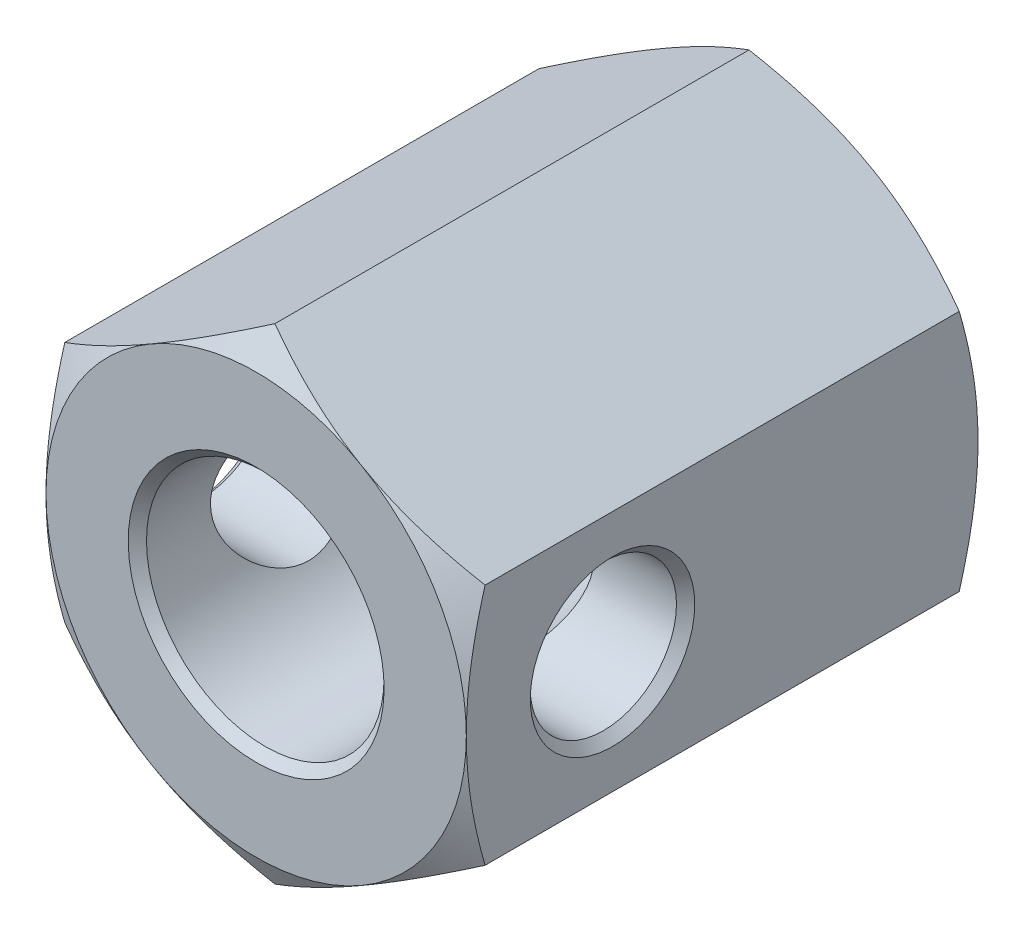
ISO-10303-21;
HEADER;
FILE_DESCRIPTION(('STEP AP214'),'2;1');
FILE_NAME('part.step','',(''),(''),'','','');
FILE_SCHEMA(('AUTOMOTIVE_DESIGN { 1 0 10303 214 1 1 1 1 }'));
ENDSEC;
DATA;
#1=APPLICATION_CONTEXT('core data for automotive mechanical design processes');
#2=APPLICATION_PROTOCOL_DEFINITION('international standard','automotive_design',2000,#1);
#3=PRODUCT_CONTEXT('',#1,'mechanical');
#4=PRODUCT('Part','Part','',(#3));
#5=PRODUCT_RELATED_PRODUCT_CATEGORY('part','',(#4));
#6=PRODUCT_DEFINITION_FORMATION('','',#4);
#7=PRODUCT_DEFINITION_CONTEXT('part definition',#1,'design');
#8=PRODUCT_DEFINITION('design','',#6,#7);
#9=PRODUCT_DEFINITION_SHAPE('','',#8);
#10=(LENGTH_UNIT() NAMED_UNIT(*) SI_UNIT(.MILLI.,.METRE.));
#11=(NAMED_UNIT(*) PLANE_ANGLE_UNIT() SI_UNIT($,.RADIAN.));
#12=(NAMED_UNIT(*) SI_UNIT($,.STERADIAN.) SOLID_ANGLE_UNIT());
#13=UNCERTAINTY_MEASURE_WITH_UNIT(LENGTH_MEASURE(1.E-05),#10,'distance_accuracy_value','');
#14=(GEOMETRIC_REPRESENTATION_CONTEXT(3) GLOBAL_UNCERTAINTY_ASSIGNED_CONTEXT((#13)) GLOBAL_UNIT_ASSIGNED_CONTEXT((#10,
#11,#12)) REPRESENTATION_CONTEXT('',''));
#15=CARTESIAN_POINT('',(0.,0.,0.));
#16=DIRECTION('',(0.,0.,1.));
#17=DIRECTION('',(1.,0.,0.));
#18=AXIS2_PLACEMENT_3D('',#15,#16,#17);
#19=CARTESIAN_POINT('',(-23.,13.2790561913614,56.));
#20=DIRECTION('',(1.,0.,0.));
#21=DIRECTION('',(0.,0.,1.));
#22=AXIS2_PLACEMENT_3D('',#19,#20,#21);
#23=PLANE('',#22);
#24=CARTESIAN_POINT('',(-23.,0.,40.));
#25=DIRECTION('',(1.,0.,0.));
#26=DIRECTION('',(0.,0.,1.));
#27=AXIS2_PLACEMENT_3D('',#24,#25,#26);
#28=CIRCLE('',#27,9.);
#29=CARTESIAN_POINT('',(-23.,0.,49.));
#30=VERTEX_POINT('',#29);
#31=EDGE_CURVE('E22',#30,#30,#28,.T.);
#32=ORIENTED_EDGE('',*,*,#31,.T.);
#33=EDGE_LOOP('',(#32));
#34=FACE_BOUND('',#33,.T.);
#35=CARTESIAN_POINT('',(-23.,35.437755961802,11.1124351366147));
#36=CARTESIAN_POINT('',(-23.,34.9364578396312,10.869667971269));
#37=CARTESIAN_POINT('',(-23.,34.4345647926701,10.6281255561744));
#38=CARTESIAN_POINT('',(-23.,33.429465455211,10.1477759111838));
#39=CARTESIAN_POINT('',(-23.,32.9262591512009,9.9089687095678));
#40=CARTESIAN_POINT('',(-23.,31.9183404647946,9.43434262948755));
#41=CARTESIAN_POINT('',(-23.,31.4136278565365,9.19852423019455));
#42=CARTESIAN_POINT('',(-23.,30.4026435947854,8.73025814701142));
#43=CARTESIAN_POINT('',(-23.,29.8963719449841,8.49781045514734));
#44=CARTESIAN_POINT('',(-23.,28.369357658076,7.80351642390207));
#45=CARTESIAN_POINT('',(-23.,27.346014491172,7.34736548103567));
#46=CARTESIAN_POINT('',(-23.,25.2911041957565,6.45401611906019));
#47=CARTESIAN_POINT('',(-23.,24.2595374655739,6.01681678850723));
#48=CARTESIAN_POINT('',(-23.,22.6885884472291,5.37240596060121));
#49=CARTESIAN_POINT('',(-23.,22.1528237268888,5.15636718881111));
#50=CARTESIAN_POINT('',(-23.,21.0784242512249,4.73155725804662));
#51=CARTESIAN_POINT('',(-23.,20.5397895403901,4.52278598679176));
#52=CARTESIAN_POINT('',(-23.,19.4593115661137,4.11345766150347));
#53=CARTESIAN_POINT('',(-23.,18.9174678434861,3.91290181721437));
#54=CARTESIAN_POINT('',(-23.,17.830408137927,3.52117308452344));
#55=CARTESIAN_POINT('',(-23.,17.2851922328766,3.32999998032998));
#56=CARTESIAN_POINT('',(-23.,16.1922613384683,2.95870329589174));
#57=CARTESIAN_POINT('',(-23.,15.644553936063,2.77855749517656));
#58=CARTESIAN_POINT('',(-23.,14.5453251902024,2.43034027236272));
#59=CARTESIAN_POINT('',(-23.,13.9938037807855,2.26226905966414));
#60=CARTESIAN_POINT('',(-23.,12.3335082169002,1.77863132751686));
#61=CARTESIAN_POINT('',(-23.,11.2185780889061,1.4834939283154));
#62=CARTESIAN_POINT('',(-23.,9.53724183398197,1.09334573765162));
#63=CARTESIAN_POINT('',(-23.,8.9768092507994,0.972308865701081));
#64=CARTESIAN_POINT('',(-23.,7.85215402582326,0.749218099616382));
#65=CARTESIAN_POINT('',(-23.,7.28793146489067,0.647163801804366));
#66=CARTESIAN_POINT('',(-23.,6.15611767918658,0.463854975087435));
#67=CARTESIAN_POINT('',(-23.,5.58852654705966,0.382599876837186));
#68=CARTESIAN_POINT('',(-23.,4.45056401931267,0.242513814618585));
#69=CARTESIAN_POINT('',(-23.,3.88019262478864,0.183682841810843));
#70=CARTESIAN_POINT('',(-23.,2.7448423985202,0.0903436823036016));
#71=CARTESIAN_POINT('',(-23.,2.17988865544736,0.0555321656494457));
#72=CARTESIAN_POINT('',(-23.,1.04901730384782,0.00981524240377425));
#73=CARTESIAN_POINT('',(-23.,0.483099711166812,-0.00109055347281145));
#74=CARTESIAN_POINT('',(-23.,-0.648692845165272,0.00126263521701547));
#75=CARTESIAN_POINT('',(-23.,-1.21456780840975,0.0145218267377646));
#76=CARTESIAN_POINT('',(-23.,-2.34526103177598,0.0648855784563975));
#77=CARTESIAN_POINT('',(-23.,-2.91007924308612,0.101991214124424));
#78=CARTESIAN_POINT('',(-23.,-4.27463163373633,0.219663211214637));
#79=CARTESIAN_POINT('',(-23.,-5.0733732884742,0.311938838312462));
#80=CARTESIAN_POINT('',(-23.,-6.66477938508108,0.539097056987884));
#81=CARTESIAN_POINT('',(-23.,-7.45744295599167,0.673985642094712));
#82=CARTESIAN_POINT('',(-23.,-9.03598961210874,0.981570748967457));
#83=CARTESIAN_POINT('',(-23.,-9.82186674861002,1.15429751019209));
#84=CARTESIAN_POINT('',(-23.,-11.3856651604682,1.53230136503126));
#85=CARTESIAN_POINT('',(-23.,-12.1635865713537,1.73757790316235));
#86=CARTESIAN_POINT('',(-23.,-13.7283804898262,2.18049570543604));
#87=CARTESIAN_POINT('',(-23.,-14.5150801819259,2.41874331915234));
#88=CARTESIAN_POINT('',(-23.,-16.0807278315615,2.91934818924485));
#89=CARTESIAN_POINT('',(-23.,-16.8596757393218,3.18170560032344));
#90=CARTESIAN_POINT('',(-23.,-18.4102130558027,3.72640904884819));
#91=CARTESIAN_POINT('',(-23.,-19.1818049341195,4.00874808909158));
#92=CARTESIAN_POINT('',(-23.,-20.7186298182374,4.59014306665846));
#93=CARTESIAN_POINT('',(-23.,-21.4838628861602,4.88919884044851));
#94=CARTESIAN_POINT('',(-23.,-23.2369659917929,5.59287124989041));
#95=CARTESIAN_POINT('',(-23.,-24.2229060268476,6.00228791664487));
#96=CARTESIAN_POINT('',(-23.,-26.1868189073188,6.83985506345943));
#97=CARTESIAN_POINT('',(-23.,-27.1647913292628,7.26800653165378));
#98=CARTESIAN_POINT('',(-23.,-29.1141841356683,8.1394347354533));
#99=CARTESIAN_POINT('',(-23.,-30.0856032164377,8.58271438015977));
#100=CARTESIAN_POINT('',(-23.,-32.0227496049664,9.48146770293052));
#101=CARTESIAN_POINT('',(-23.,-32.9884770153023,9.9369411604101));
#102=CARTESIAN_POINT('',(-23.,-34.9160961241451,10.8583379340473));
#103=CARTESIAN_POINT('',(-23.,-35.8779831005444,11.324271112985));
#104=CARTESIAN_POINT('',(-23.,-37.7976990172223,12.2644214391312));
#105=CARTESIAN_POINT('',(-23.,-38.7555279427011,12.7386386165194));
#106=CARTESIAN_POINT('',(-23.,-40.667625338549,13.6939314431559));
#107=CARTESIAN_POINT('',(-23.,-41.6218941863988,14.1750063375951));
#108=CARTESIAN_POINT('',(-23.,-43.5274701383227,15.1429770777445));
#109=CARTESIAN_POINT('',(-23.,-44.4787772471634,15.6298729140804));
#110=CARTESIAN_POINT('',(-23.,-47.1781659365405,17.0202996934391));
#111=CARTESIAN_POINT('',(-23.,-48.9232186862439,17.929711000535));
#112=CARTESIAN_POINT('',(-23.,-52.4067765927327,19.7610882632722));
#113=CARTESIAN_POINT('',(-23.,-54.1452815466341,20.6830546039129));
#114=CARTESIAN_POINT('',(-23.,-57.6131692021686,22.5345482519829));
#115=CARTESIAN_POINT('',(-23.,-59.3425636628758,23.4640535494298));
#116=CARTESIAN_POINT('',(-23.,-61.9335390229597,24.8639687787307));
#117=CARTESIAN_POINT('',(-23.,-62.7966568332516,25.331538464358));
#118=CARTESIAN_POINT('',(-23.,-64.5219678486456,26.268377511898));
#119=CARTESIAN_POINT('',(-23.,-65.3841610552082,26.7376468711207));
#120=CARTESIAN_POINT('',(-23.,-66.2459432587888,27.207670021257));
#121=B_SPLINE_CURVE_WITH_KNOTS('',3,(#35,#36,#37,#38,#39,#40,#41,#42,#43,#44,#45,#46,#47,#48,
#49,#50,#51,#52,#53,#54,#55,#56,#57,#58,#59,#60,#61,#62,#63,#64,#65,#66,#67,#68,#69,#70,#71,#72,
#73,#74,#75,#76,#77,#78,#79,#80,#81,#82,#83,#84,#85,#86,#87,#88,#89,#90,#91,#92,#93,#94,#95,#96,
#97,#98,#99,#100,#101,#102,#103,#104,#105,#106,#107,#108,#109,#110,#111,#112,#113,#114,#115,
#116,#117,#118,#119,#120),.UNSPECIFIED.,.F.,.F.,(4,2,2,2,2,2,2,2,2,2,2,2,2,2,2,2,2,2,2,2,2,2,2,
2,2,2,2,2,2,2,2,2,2,2,2,2,2,2,2,2,2,2,4),(0.,1.67096484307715,3.34194694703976,5.01319364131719,
6.68443638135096,10.0454983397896,13.4063984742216,15.1394016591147,16.8723780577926,
18.6056087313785,20.3387995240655,22.0683743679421,23.797979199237,27.2558421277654,
28.975645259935,30.695411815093,32.4151312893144,34.1348500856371,35.8324330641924,
37.5299883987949,39.2275582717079,40.9252047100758,43.3360277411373,45.747190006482,
48.1602862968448,50.5733414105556,53.0388316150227,55.5043376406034,57.9689845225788,
60.4336072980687,63.6360517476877,66.838665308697,70.0418982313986,73.2450732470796,
76.4514072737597,79.6577529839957,82.863748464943,86.0697387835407,91.9730628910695,
97.8765684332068,103.766624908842,106.711507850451,109.656386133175),.UNSPECIFIED.);
#122=CARTESIAN_POINT('',(-23.,-13.2790561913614,2.0542771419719));
#123=VERTEX_POINT('',#122);
#124=CARTESIAN_POINT('',(-23.,0.,0.));
#125=VERTEX_POINT('',#124);
#126=EDGE_CURVE('E299',#123,#125,#121,.F.);
#127=ORIENTED_EDGE('',*,*,#126,.F.);
#128=DIRECTION('',(0.,0.,-1.));
#129=VECTOR('',#128,1.);
#130=CARTESIAN_POINT('',(-23.,-13.2790561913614,56.));
#131=LINE('',#130,#129);
#132=CARTESIAN_POINT('',(-23.,-13.2790561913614,53.9457228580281));
#133=VERTEX_POINT('',#132);
#134=EDGE_CURVE('E302',#133,#123,#131,.T.);
#135=ORIENTED_EDGE('',*,*,#134,.F.);
#136=CARTESIAN_POINT('',(-23.,35.437755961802,44.8875648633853));
#137=CARTESIAN_POINT('',(-23.,34.9364578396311,45.1303320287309));
#138=CARTESIAN_POINT('',(-23.,34.43456479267,45.3718744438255));
#139=CARTESIAN_POINT('',(-23.,33.4294654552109,45.8522240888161));
#140=CARTESIAN_POINT('',(-23.,32.9262591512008,46.0910312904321));
#141=CARTESIAN_POINT('',(-23.,31.9183404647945,46.5656573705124));
#142=CARTESIAN_POINT('',(-23.,31.4136278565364,46.8014757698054));
#143=CARTESIAN_POINT('',(-23.,30.4026435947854,47.2697418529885));
#144=CARTESIAN_POINT('',(-23.,29.896371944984,47.5021895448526));
#145=CARTESIAN_POINT('',(-23.,28.3693576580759,48.1964835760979));
#146=CARTESIAN_POINT('',(-23.,27.3460144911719,48.6526345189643));
#147=CARTESIAN_POINT('',(-23.,25.2911041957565,49.5459838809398));
#148=CARTESIAN_POINT('',(-23.,24.2595374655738,49.9831832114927));
#149=CARTESIAN_POINT('',(-23.,22.6885884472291,50.6275940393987));
#150=CARTESIAN_POINT('',(-23.,22.1528237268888,50.8436328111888));
#151=CARTESIAN_POINT('',(-23.,21.0784242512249,51.2684427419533));
#152=CARTESIAN_POINT('',(-23.,20.5397895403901,51.4772140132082));
#153=CARTESIAN_POINT('',(-23.,19.4593115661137,51.8865423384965));
#154=CARTESIAN_POINT('',(-23.,18.9174678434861,52.0870981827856));
#155=CARTESIAN_POINT('',(-23.,17.8304081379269,52.4788269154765));
#156=CARTESIAN_POINT('',(-23.,17.2851922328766,52.67000001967));
#157=CARTESIAN_POINT('',(-23.,16.1922613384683,53.0412967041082));
#158=CARTESIAN_POINT('',(-23.,15.644553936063,53.2214425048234));
#159=CARTESIAN_POINT('',(-23.,14.5453251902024,53.5696597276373));
#160=CARTESIAN_POINT('',(-23.,13.9938037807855,53.7377309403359));
#161=CARTESIAN_POINT('',(-23.,12.3335082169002,54.2213686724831));
#162=CARTESIAN_POINT('',(-23.,11.2185780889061,54.5165060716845));
#163=CARTESIAN_POINT('',(-23.,9.53724183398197,54.9066542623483));
#164=CARTESIAN_POINT('',(-23.,8.97680925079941,55.0276911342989));
#165=CARTESIAN_POINT('',(-23.,7.85215402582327,55.2507819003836));
#166=CARTESIAN_POINT('',(-23.,7.28793146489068,55.3528361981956));
#167=CARTESIAN_POINT('',(-23.,6.15611767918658,55.5361450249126));
#168=CARTESIAN_POINT('',(-23.,5.58852654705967,55.6174001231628));
#169=CARTESIAN_POINT('',(-23.,4.45056401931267,55.7574861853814));
#170=CARTESIAN_POINT('',(-23.,3.88019262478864,55.8163171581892));
#171=CARTESIAN_POINT('',(-23.,2.7448423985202,55.9096563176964));
#172=CARTESIAN_POINT('',(-23.,2.17988865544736,55.9444678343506));
#173=CARTESIAN_POINT('',(-23.,1.04901730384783,55.9901847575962));
#174=CARTESIAN_POINT('',(-23.,0.483099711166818,56.0010905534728));
#175=CARTESIAN_POINT('',(-23.,-0.648692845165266,55.998737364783));
#176=CARTESIAN_POINT('',(-23.,-1.21456780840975,55.9854781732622));
#177=CARTESIAN_POINT('',(-23.,-2.34526103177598,55.9351144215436));
#178=CARTESIAN_POINT('',(-23.,-2.91007924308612,55.8980087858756));
#179=CARTESIAN_POINT('',(-23.,-4.27463163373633,55.7803367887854));
#180=CARTESIAN_POINT('',(-23.,-5.07337328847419,55.6880611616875));
#181=CARTESIAN_POINT('',(-23.,-6.66477938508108,55.4609029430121));
#182=CARTESIAN_POINT('',(-23.,-7.45744295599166,55.3260143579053));
#183=CARTESIAN_POINT('',(-23.,-9.03598961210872,55.0184292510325));
#184=CARTESIAN_POINT('',(-23.,-9.82186674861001,54.8457024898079));
#185=CARTESIAN_POINT('',(-23.,-11.3856651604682,54.4676986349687));
#186=CARTESIAN_POINT('',(-23.,-12.1635865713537,54.2624220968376));
#187=CARTESIAN_POINT('',(-23.,-13.7283804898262,53.8195042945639));
#188=CARTESIAN_POINT('',(-23.,-14.5150801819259,53.5812566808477));
#189=CARTESIAN_POINT('',(-23.,-16.0807278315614,53.0806518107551));
#190=CARTESIAN_POINT('',(-23.,-16.8596757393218,52.8182943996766));
#191=CARTESIAN_POINT('',(-23.,-18.4102130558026,52.2735909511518));
#192=CARTESIAN_POINT('',(-23.,-19.1818049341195,51.9912519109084));
#193=CARTESIAN_POINT('',(-23.,-20.7186298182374,51.4098569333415));
#194=CARTESIAN_POINT('',(-23.,-21.4838628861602,51.1108011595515));
#195=CARTESIAN_POINT('',(-23.,-23.2369659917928,50.4071287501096));
#196=CARTESIAN_POINT('',(-23.,-24.2229060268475,49.9977120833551));
#197=CARTESIAN_POINT('',(-23.,-26.1868189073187,49.1601449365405));
#198=CARTESIAN_POINT('',(-23.,-27.1647913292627,48.7319934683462));
#199=CARTESIAN_POINT('',(-23.,-29.1141841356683,47.8605652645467));
#200=CARTESIAN_POINT('',(-23.,-30.0856032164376,47.4172856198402));
#201=CARTESIAN_POINT('',(-23.,-32.0227496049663,46.5185322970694));
#202=CARTESIAN_POINT('',(-23.,-32.9884770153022,46.0630588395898));
#203=CARTESIAN_POINT('',(-23.,-34.916096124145,45.1416620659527));
#204=CARTESIAN_POINT('',(-23.,-35.8779831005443,44.6757288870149));
#205=CARTESIAN_POINT('',(-23.,-37.7976990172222,43.7355785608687));
#206=CARTESIAN_POINT('',(-23.,-38.755527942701,43.2613613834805));
#207=CARTESIAN_POINT('',(-23.,-40.6676253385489,42.3060685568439));
#208=CARTESIAN_POINT('',(-23.,-41.6218941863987,41.8249936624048));
#209=CARTESIAN_POINT('',(-23.,-43.5274701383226,40.8570229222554));
#210=CARTESIAN_POINT('',(-23.,-44.4787772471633,40.3701270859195));
#211=CARTESIAN_POINT('',(-23.,-47.1781659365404,38.9797003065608));
#212=CARTESIAN_POINT('',(-23.,-48.9232186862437,38.0702889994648));
#213=CARTESIAN_POINT('',(-23.,-52.4067765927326,36.2389117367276));
#214=CARTESIAN_POINT('',(-23.,-54.145281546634,35.316945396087));
#215=CARTESIAN_POINT('',(-23.,-57.6131692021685,33.4654517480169));
#216=CARTESIAN_POINT('',(-23.,-59.3425636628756,32.53594645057));
#217=CARTESIAN_POINT('',(-23.,-61.9335390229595,31.1360312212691));
#218=CARTESIAN_POINT('',(-23.,-62.7966568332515,30.6684615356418));
#219=CARTESIAN_POINT('',(-23.,-64.5219678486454,29.7316224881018));
#220=CARTESIAN_POINT('',(-23.,-65.3841610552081,29.2623531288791));
#221=CARTESIAN_POINT('',(-23.,-66.2459432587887,28.792329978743));
#222=B_SPLINE_CURVE_WITH_KNOTS('',3,(#136,#137,#138,#139,#140,#141,#142,#143,#144,#145,#146,
#147,#148,#149,#150,#151,#152,#153,#154,#155,#156,#157,#158,#159,#160,#161,#162,#163,#164,#165,
#166,#167,#168,#169,#170,#171,#172,#173,#174,#175,#176,#177,#178,#179,#180,#181,#182,#183,#184,
#185,#186,#187,#188,#189,#190,#191,#192,#193,#194,#195,#196,#197,#198,#199,#200,#201,#202,#203,
#204,#205,#206,#207,#208,#209,#210,#211,#212,#213,#214,#215,#216,#217,#218,#219,#220,#221),
.UNSPECIFIED.,.F.,.F.,(4,2,2,2,2,2,2,2,2,2,2,2,2,2,2,2,2,2,2,2,2,2,2,2,2,2,2,2,2,2,2,2,2,2,2,2,
2,2,2,2,2,2,4),(0.,1.67096484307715,3.34194694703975,5.01319364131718,6.68443638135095,
10.0454983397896,13.4063984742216,15.1394016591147,16.8723780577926,18.6056087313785,
20.3387995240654,22.0683743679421,23.797979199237,27.2558421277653,28.9756452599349,
30.6954118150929,32.4151312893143,34.134850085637,35.8324330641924,37.5299883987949,
39.2275582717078,40.9252047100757,43.3360277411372,45.747190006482,48.1602862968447,
50.5733414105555,53.0388316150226,55.5043376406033,57.9689845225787,60.4336072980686,
63.6360517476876,66.8386653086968,70.0418982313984,73.2450732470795,76.4514072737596,
79.6577529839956,82.8637484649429,86.0697387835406,91.9730628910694,97.8765684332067,
103.766624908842,106.711507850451,109.656386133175),.UNSPECIFIED.);
#223=CARTESIAN_POINT('',(-23.,0.,56.));
#224=VERTEX_POINT('',#223);
#225=EDGE_CURVE('E238',#224,#133,#222,.T.);
#226=ORIENTED_EDGE('',*,*,#225,.F.);
#227=CARTESIAN_POINT('',(-23.,13.2790561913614,53.9457228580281));
#228=VERTEX_POINT('',#227);
#229=EDGE_CURVE('E368',#228,#224,#222,.T.);
#230=ORIENTED_EDGE('',*,*,#229,.F.);
#231=DIRECTION('',(0.,0.,-1.));
#232=VECTOR('',#231,1.);
#233=CARTESIAN_POINT('',(-23.,13.2790561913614,56.));
#234=LINE('',#233,#232);
#235=CARTESIAN_POINT('',(-23.,13.2790561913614,2.0542771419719));
#236=VERTEX_POINT('',#235);
#237=EDGE_CURVE('E362',#228,#236,#234,.T.);
#238=ORIENTED_EDGE('',*,*,#237,.T.);
#239=EDGE_CURVE('E192',#125,#236,#121,.F.);
#240=ORIENTED_EDGE('',*,*,#239,.F.);
#241=EDGE_LOOP('',(#127,#135,#226,#230,#238,#240));
#242=FACE_BOUND('',#241,.T.);
#243=ADVANCED_FACE('F14',(#34,#242),#23,.F.);
#244=CARTESIAN_POINT('',(-23.,-13.2790561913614,56.));
#245=DIRECTION('',(0.5,0.866025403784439,0.));
#246=DIRECTION('',(-0.866025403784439,0.5,0.));
#247=AXIS2_PLACEMENT_3D('',#244,#245,#246);
#248=PLANE('',#247);
#249=CARTESIAN_POINT('',(0.000199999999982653,-26.5582278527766,2.05434380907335));
#250=CARTESIAN_POINT('',(-0.505330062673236,-26.2663599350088,1.88584599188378));
#251=CARTESIAN_POINT('',(-1.01283196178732,-25.973353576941,1.72499439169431));
#252=CARTESIAN_POINT('',(-2.03190531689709,-25.3849913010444,1.42070899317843));
#253=CARTESIAN_POINT('',(-2.54347805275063,-25.0896346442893,1.27728092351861));
#254=CARTESIAN_POINT('',(-3.57169268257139,-24.4959946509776,1.00976772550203));
#255=CARTESIAN_POINT('',(-4.08834365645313,-24.1977060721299,0.885728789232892));
#256=CARTESIAN_POINT('',(-5.12521364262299,-23.5990689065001,0.659665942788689));
#257=CARTESIAN_POINT('',(-5.64543229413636,-23.2987205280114,0.557639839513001));
#258=CARTESIAN_POINT('',(-6.67614041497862,-22.7036409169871,0.379933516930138));
#259=CARTESIAN_POINT('',(-7.18655343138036,-22.4089538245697,0.303665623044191));
#260=CARTESIAN_POINT('',(-8.20971821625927,-21.8182293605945,0.175781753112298));
#261=CARTESIAN_POINT('',(-8.72247002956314,-21.5221919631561,0.124166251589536));
#262=CARTESIAN_POINT('',(-9.74883498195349,-20.9296198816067,0.0468904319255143));
#263=CARTESIAN_POINT('',(-10.262446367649,-20.6330862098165,0.0211992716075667));
#264=CARTESIAN_POINT('',(-11.290143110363,-20.0397452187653,-0.00367538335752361));
#265=CARTESIAN_POINT('',(-11.8042284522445,-19.7429379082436,-0.00285969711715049));
#266=CARTESIAN_POINT('',(-12.7653194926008,-19.1880517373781,0.0234279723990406));
#267=CARTESIAN_POINT('',(-13.2123936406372,-18.9299333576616,0.0456944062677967));
#268=CARTESIAN_POINT('',(-14.1054746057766,-18.4143128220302,0.109851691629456));
#269=CARTESIAN_POINT('',(-14.551481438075,-18.1568106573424,0.151742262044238));
#270=CARTESIAN_POINT('',(-15.4422629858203,-17.6425176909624,0.254421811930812));
#271=CARTESIAN_POINT('',(-15.8870362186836,-17.3857277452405,0.315227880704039));
#272=CARTESIAN_POINT('',(-16.7744530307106,-16.8733774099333,0.454662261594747));
#273=CARTESIAN_POINT('',(-17.2170966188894,-16.6178170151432,0.533290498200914));
#274=CARTESIAN_POINT('',(-18.5608682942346,-15.8419900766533,0.79792633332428));
#275=CARTESIAN_POINT('',(-19.4581784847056,-15.3239277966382,1.01033549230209));
#276=CARTESIAN_POINT('',(-20.7942343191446,-14.5525556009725,1.37195212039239));
#277=CARTESIAN_POINT('',(-21.2375518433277,-14.2966061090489,1.4995280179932));
#278=CARTESIAN_POINT('',(-22.1211205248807,-13.7864774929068,1.76759530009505));
#279=CARTESIAN_POINT('',(-22.5613725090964,-13.5322978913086,1.9080830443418));
#280=CARTESIAN_POINT('',(-23.0002,-13.2789407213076,2.05434380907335));
#281=B_SPLINE_CURVE_WITH_KNOTS('',3,(#249,#250,#251,#252,#253,#254,#255,#256,#257,#258,#259,
#260,#261,#262,#263,#264,#265,#266,#267,#268,#269,#270,#271,#272,#273,#274,#275,#276,#277,#278,
#279,#280),.UNSPECIFIED.,.F.,.F.,(4,2,2,2,2,2,2,2,2,2,2,2,2,2,2,4),(0.,1.8227520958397,
3.64610187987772,5.47373144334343,7.30117883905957,9.08355891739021,10.8659733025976,
12.6462646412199,14.4265009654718,15.9762768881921,17.5260306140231,19.0771885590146,
20.6283399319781,23.7989683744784,25.381520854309,26.9636285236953),.UNSPECIFIED.);
#282=CARTESIAN_POINT('',(0.,-26.5581123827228,2.0542771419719));
#283=VERTEX_POINT('',#282);
#284=CARTESIAN_POINT('',(-11.5,-19.9185842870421,0.));
#285=VERTEX_POINT('',#284);
#286=EDGE_CURVE('E124',#283,#285,#281,.T.);
#287=ORIENTED_EDGE('',*,*,#286,.F.);
#288=DIRECTION('',(0.,0.,-1.));
#289=VECTOR('',#288,1.);
#290=CARTESIAN_POINT('',(0.,-26.5581123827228,56.));
#291=LINE('',#290,#289);
#292=CARTESIAN_POINT('',(0.,-26.5581123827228,53.9457228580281));
#293=VERTEX_POINT('',#292);
#294=EDGE_CURVE('E140',#293,#283,#291,.T.);
#295=ORIENTED_EDGE('',*,*,#294,.F.);
#296=CARTESIAN_POINT('',(-23.0002,-13.2789407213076,53.9456561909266));
#297=CARTESIAN_POINT('',(-22.4946699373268,-13.5708086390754,54.1141540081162));
#298=CARTESIAN_POINT('',(-21.9871680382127,-13.8638149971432,54.2750056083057));
#299=CARTESIAN_POINT('',(-20.9680946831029,-14.4521772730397,54.5792910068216));
#300=CARTESIAN_POINT('',(-20.4565219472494,-14.7475339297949,54.7227190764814));
#301=CARTESIAN_POINT('',(-19.4283073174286,-15.3411739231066,54.990232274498));
#302=CARTESIAN_POINT('',(-18.9116563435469,-15.6394625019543,55.1142712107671));
#303=CARTESIAN_POINT('',(-17.874786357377,-16.2380996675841,55.3403340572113));
#304=CARTESIAN_POINT('',(-17.3545677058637,-16.5384480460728,55.442360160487));
#305=CARTESIAN_POINT('',(-16.3238595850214,-17.133527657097,55.6200664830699));
#306=CARTESIAN_POINT('',(-15.8134465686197,-17.4282147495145,55.6963343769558));
#307=CARTESIAN_POINT('',(-14.7902817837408,-18.0189392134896,55.8242182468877));
#308=CARTESIAN_POINT('',(-14.2775299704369,-18.3149766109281,55.8758337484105));
#309=CARTESIAN_POINT('',(-13.2511650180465,-18.9075486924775,55.9531095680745));
#310=CARTESIAN_POINT('',(-12.737553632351,-19.2040823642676,55.9788007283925));
#311=CARTESIAN_POINT('',(-11.709856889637,-19.7974233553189,56.0036753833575));
#312=CARTESIAN_POINT('',(-11.1957715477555,-20.0942306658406,56.0028596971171));
#313=CARTESIAN_POINT('',(-10.2346805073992,-20.649116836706,55.9765720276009));
#314=CARTESIAN_POINT('',(-9.78760635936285,-20.9072352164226,55.9543055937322));
#315=CARTESIAN_POINT('',(-8.89452539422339,-21.422855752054,55.8901483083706));
#316=CARTESIAN_POINT('',(-8.44851856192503,-21.6803579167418,55.8482577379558));
#317=CARTESIAN_POINT('',(-7.55773701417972,-22.1946508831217,55.7455781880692));
#318=CARTESIAN_POINT('',(-7.11296378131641,-22.4514408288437,55.684772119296));
#319=CARTESIAN_POINT('',(-6.2255469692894,-22.9637911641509,55.5453377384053));
#320=CARTESIAN_POINT('',(-5.78290338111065,-23.219351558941,55.4667095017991));
#321=CARTESIAN_POINT('',(-4.43913170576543,-23.9951784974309,55.2020736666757));
#322=CARTESIAN_POINT('',(-3.54182151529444,-24.5132407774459,54.9896645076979));
#323=CARTESIAN_POINT('',(-2.20576568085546,-25.2846129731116,54.6280478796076));
#324=CARTESIAN_POINT('',(-1.76244815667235,-25.5405624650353,54.5004719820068));
#325=CARTESIAN_POINT('',(-0.878879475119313,-26.0506910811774,54.2324046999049));
#326=CARTESIAN_POINT('',(-0.438627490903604,-26.3048706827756,54.0919169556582));
#327=CARTESIAN_POINT('',(0.000199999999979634,-26.5582278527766,53.9456561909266));
#328=B_SPLINE_CURVE_WITH_KNOTS('',3,(#296,#297,#298,#299,#300,#301,#302,#303,#304,#305,#306,
#307,#308,#309,#310,#311,#312,#313,#314,#315,#316,#317,#318,#319,#320,#321,#322,#323,#324,#325,
#326,#327),.UNSPECIFIED.,.F.,.F.,(4,2,2,2,2,2,2,2,2,2,2,2,2,2,2,4),(0.,1.82275209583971,
3.64610187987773,5.47373144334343,7.30117883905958,9.08355891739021,10.8659733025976,
12.6462646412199,14.4265009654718,15.9762768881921,17.5260306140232,19.0771885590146,
20.6283399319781,23.7989683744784,25.381520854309,26.9636285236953),.UNSPECIFIED.);
#329=CARTESIAN_POINT('',(-11.5,-19.9185842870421,56.));
#330=VERTEX_POINT('',#329);
#331=EDGE_CURVE('E231',#330,#293,#328,.T.);
#332=ORIENTED_EDGE('',*,*,#331,.F.);
#333=EDGE_CURVE('E237',#133,#330,#328,.T.);
#334=ORIENTED_EDGE('',*,*,#333,.F.);
#335=ORIENTED_EDGE('',*,*,#134,.T.);
#336=EDGE_CURVE('E150',#285,#123,#281,.T.);
#337=ORIENTED_EDGE('',*,*,#336,.F.);
#338=EDGE_LOOP('',(#287,#295,#332,#334,#335,#337));
#339=FACE_BOUND('',#338,.T.);
#340=ADVANCED_FACE('F244',(#339),#248,.F.);
#341=CARTESIAN_POINT('',(0.,-26.5581123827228,56.));
#342=DIRECTION('',(-0.5,0.866025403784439,0.));
#343=DIRECTION('',(-0.866025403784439,-0.5,0.));
#344=AXIS2_PLACEMENT_3D('',#341,#342,#343);
#345=PLANE('',#344);
#346=CARTESIAN_POINT('',(23.0002,-13.2789407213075,2.05434380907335));
#347=CARTESIAN_POINT('',(22.4946699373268,-13.5708086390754,1.88584599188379));
#348=CARTESIAN_POINT('',(21.9871680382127,-13.8638149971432,1.72499439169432));
#349=CARTESIAN_POINT('',(20.9680946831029,-14.4521772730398,1.42070899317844));
#350=CARTESIAN_POINT('',(20.4565219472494,-14.7475339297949,1.27728092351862));
#351=CARTESIAN_POINT('',(19.4283073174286,-15.3411739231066,1.00976772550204));
#352=CARTESIAN_POINT('',(18.9116563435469,-15.6394625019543,0.885728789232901));
#353=CARTESIAN_POINT('',(17.874786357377,-16.2380996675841,0.659665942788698));
#354=CARTESIAN_POINT('',(17.3545677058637,-16.5384480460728,0.557639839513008));
#355=CARTESIAN_POINT('',(16.3238595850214,-17.133527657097,0.379933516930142));
#356=CARTESIAN_POINT('',(15.8134465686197,-17.4282147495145,0.303665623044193));
#357=CARTESIAN_POINT('',(14.7902817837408,-18.0189392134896,0.1757817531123));
#358=CARTESIAN_POINT('',(14.2775299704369,-18.3149766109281,0.124166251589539));
#359=CARTESIAN_POINT('',(13.2511650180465,-18.9075486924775,0.04689043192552));
#360=CARTESIAN_POINT('',(12.737553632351,-19.2040823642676,0.0211992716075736));
#361=CARTESIAN_POINT('',(11.709856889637,-19.7974233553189,-0.00367538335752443));
#362=CARTESIAN_POINT('',(11.1957715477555,-20.0942306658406,-0.00285969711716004));
#363=CARTESIAN_POINT('',(10.2346805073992,-20.649116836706,0.0234279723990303));
#364=CARTESIAN_POINT('',(9.78760635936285,-20.9072352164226,0.0456944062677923));
#365=CARTESIAN_POINT('',(8.89452539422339,-21.422855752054,0.109851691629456));
#366=CARTESIAN_POINT('',(8.44851856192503,-21.6803579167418,0.151742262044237));
#367=CARTESIAN_POINT('',(7.55773701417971,-22.1946508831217,0.254421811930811));
#368=CARTESIAN_POINT('',(7.11296378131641,-22.4514408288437,0.315227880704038));
#369=CARTESIAN_POINT('',(6.2255469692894,-22.9637911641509,0.454662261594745));
#370=CARTESIAN_POINT('',(5.78290338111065,-23.219351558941,0.53329049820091));
#371=CARTESIAN_POINT('',(4.43913170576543,-23.9951784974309,0.797926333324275));
#372=CARTESIAN_POINT('',(3.54182151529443,-24.5132407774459,1.01033549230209));
#373=CARTESIAN_POINT('',(2.20576568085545,-25.2846129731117,1.37195212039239));
#374=CARTESIAN_POINT('',(1.76244815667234,-25.5405624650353,1.49952801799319));
#375=CARTESIAN_POINT('',(0.878879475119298,-26.0506910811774,1.76759530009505));
#376=CARTESIAN_POINT('',(0.438627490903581,-26.3048706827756,1.9080830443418));
#377=CARTESIAN_POINT('',(-0.000200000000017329,-26.5582278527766,2.05434380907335));
#378=B_SPLINE_CURVE_WITH_KNOTS('',3,(#346,#347,#348,#349,#350,#351,#352,#353,#354,#355,#356,
#357,#358,#359,#360,#361,#362,#363,#364,#365,#366,#367,#368,#369,#370,#371,#372,#373,#374,#375,
#376,#377),.UNSPECIFIED.,.F.,.F.,(4,2,2,2,2,2,2,2,2,2,2,2,2,2,2,4),(0.,1.82275209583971,
3.64610187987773,5.47373144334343,7.30117883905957,9.08355891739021,10.8659733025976,
12.6462646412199,14.4265009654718,15.9762768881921,17.5260306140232,19.0771885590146,
20.6283399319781,23.7989683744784,25.381520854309,26.9636285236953),.UNSPECIFIED.);
#379=CARTESIAN_POINT('',(23.,-13.2790561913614,2.0542771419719));
#380=VERTEX_POINT('',#379);
#381=CARTESIAN_POINT('',(11.5,-19.9185842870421,0.));
#382=VERTEX_POINT('',#381);
#383=EDGE_CURVE('E103',#380,#382,#378,.T.);
#384=ORIENTED_EDGE('',*,*,#383,.F.);
#385=DIRECTION('',(0.,0.,-1.));
#386=VECTOR('',#385,1.);
#387=CARTESIAN_POINT('',(23.,-13.2790561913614,56.));
#388=LINE('',#387,#386);
#389=CARTESIAN_POINT('',(23.,-13.2790561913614,53.9457228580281));
#390=VERTEX_POINT('',#389);
#391=EDGE_CURVE('E312',#390,#380,#388,.T.);
#392=ORIENTED_EDGE('',*,*,#391,.F.);
#393=CARTESIAN_POINT('',(-0.000200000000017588,-26.5582278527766,53.9456561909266));
#394=CARTESIAN_POINT('',(0.505330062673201,-26.2663599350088,54.1141540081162));
#395=CARTESIAN_POINT('',(1.01283196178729,-25.973353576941,54.2750056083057));
#396=CARTESIAN_POINT('',(2.03190531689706,-25.3849913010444,54.5792910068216));
#397=CARTESIAN_POINT('',(2.5434780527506,-25.0896346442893,54.7227190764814));
#398=CARTESIAN_POINT('',(3.57169268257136,-24.4959946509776,54.990232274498));
#399=CARTESIAN_POINT('',(4.0883436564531,-24.1977060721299,55.1142712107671));
#400=CARTESIAN_POINT('',(5.12521364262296,-23.5990689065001,55.3403340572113));
#401=CARTESIAN_POINT('',(5.64543229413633,-23.2987205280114,55.442360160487));
#402=CARTESIAN_POINT('',(6.67614041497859,-22.7036409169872,55.6200664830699));
#403=CARTESIAN_POINT('',(7.18655343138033,-22.4089538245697,55.6963343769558));
#404=CARTESIAN_POINT('',(8.20971821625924,-21.8182293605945,55.8242182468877));
#405=CARTESIAN_POINT('',(8.72247002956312,-21.5221919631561,55.8758337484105));
#406=CARTESIAN_POINT('',(9.74883498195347,-20.9296198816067,55.9531095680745));
#407=CARTESIAN_POINT('',(10.262446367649,-20.6330862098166,55.9788007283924));
#408=CARTESIAN_POINT('',(11.290143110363,-20.0397452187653,56.0036753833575));
#409=CARTESIAN_POINT('',(11.8042284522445,-19.7429379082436,56.0028596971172));
#410=CARTESIAN_POINT('',(12.7653194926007,-19.1880517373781,55.976572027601));
#411=CARTESIAN_POINT('',(13.2123936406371,-18.9299333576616,55.9543055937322));
#412=CARTESIAN_POINT('',(14.1054746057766,-18.4143128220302,55.8901483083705));
#413=CARTESIAN_POINT('',(14.551481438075,-18.1568106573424,55.8482577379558));
#414=CARTESIAN_POINT('',(15.4422629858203,-17.6425176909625,55.7455781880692));
#415=CARTESIAN_POINT('',(15.8870362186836,-17.3857277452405,55.684772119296));
#416=CARTESIAN_POINT('',(16.7744530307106,-16.8733774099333,55.5453377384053));
#417=CARTESIAN_POINT('',(17.2170966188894,-16.6178170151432,55.4667095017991));
#418=CARTESIAN_POINT('',(18.5608682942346,-15.8419900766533,55.2020736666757));
#419=CARTESIAN_POINT('',(19.4581784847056,-15.3239277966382,54.9896645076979));
#420=CARTESIAN_POINT('',(20.7942343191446,-14.5525556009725,54.6280478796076));
#421=CARTESIAN_POINT('',(21.2375518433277,-14.2966061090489,54.5004719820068));
#422=CARTESIAN_POINT('',(22.1211205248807,-13.7864774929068,54.2324046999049));
#423=CARTESIAN_POINT('',(22.5613725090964,-13.5322978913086,54.0919169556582));
#424=CARTESIAN_POINT('',(23.0002,-13.2789407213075,53.9456561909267));
#425=B_SPLINE_CURVE_WITH_KNOTS('',3,(#393,#394,#395,#396,#397,#398,#399,#400,#401,#402,#403,
#404,#405,#406,#407,#408,#409,#410,#411,#412,#413,#414,#415,#416,#417,#418,#419,#420,#421,#422,
#423,#424),.UNSPECIFIED.,.F.,.F.,(4,2,2,2,2,2,2,2,2,2,2,2,2,2,2,4),(0.,1.82275209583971,
3.64610187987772,5.47373144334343,7.30117883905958,9.08355891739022,10.8659733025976,
12.6462646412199,14.4265009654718,15.9762768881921,17.5260306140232,19.0771885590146,
20.6283399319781,23.7989683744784,25.381520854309,26.9636285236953),.UNSPECIFIED.);
#426=CARTESIAN_POINT('',(11.5,-19.9185842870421,56.));
#427=VERTEX_POINT('',#426);
#428=EDGE_CURVE('E224',#427,#390,#425,.T.);
#429=ORIENTED_EDGE('',*,*,#428,.F.);
#430=EDGE_CURVE('E230',#293,#427,#425,.T.);
#431=ORIENTED_EDGE('',*,*,#430,.F.);
#432=ORIENTED_EDGE('',*,*,#294,.T.);
#433=EDGE_CURVE('E116',#382,#283,#378,.T.);
#434=ORIENTED_EDGE('',*,*,#433,.F.);
#435=EDGE_LOOP('',(#384,#392,#429,#431,#432,#434));
#436=FACE_BOUND('',#435,.T.);
#437=ADVANCED_FACE('F137',(#436),#345,.F.);
#438=CARTESIAN_POINT('',(23.,-13.2790561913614,56.));
#439=DIRECTION('',(-1.,0.,0.));
#440=DIRECTION('',(0.,0.,-1.));
#441=AXIS2_PLACEMENT_3D('',#438,#439,#440);
#442=PLANE('',#441);
#443=CARTESIAN_POINT('',(23.,0.,40.));
#444=DIRECTION('',(-1.,0.,0.));
#445=DIRECTION('',(0.,0.,-1.));
#446=AXIS2_PLACEMENT_3D('',#443,#444,#445);
#447=CIRCLE('',#446,9.);
#448=CARTESIAN_POINT('',(23.,0.,31.));
#449=VERTEX_POINT('',#448);
#450=EDGE_CURVE('E275',#449,#449,#447,.T.);
#451=ORIENTED_EDGE('',*,*,#450,.T.);
#452=EDGE_LOOP('',(#451));
#453=FACE_BOUND('',#452,.T.);
#454=CARTESIAN_POINT('',(23.,35.437755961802,11.1124351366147));
#455=CARTESIAN_POINT('',(23.,34.9364578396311,10.869667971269));
#456=CARTESIAN_POINT('',(23.,34.43456479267,10.6281255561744));
#457=CARTESIAN_POINT('',(23.,33.4294654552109,10.1477759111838));
#458=CARTESIAN_POINT('',(23.,32.9262591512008,9.90896870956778));
#459=CARTESIAN_POINT('',(23.,31.9183404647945,9.43434262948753));
#460=CARTESIAN_POINT('',(23.,31.4136278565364,9.19852423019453));
#461=CARTESIAN_POINT('',(23.,30.4026435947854,8.7302581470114));
#462=CARTESIAN_POINT('',(23.,29.8963719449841,8.49781045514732));
#463=CARTESIAN_POINT('',(23.,28.369357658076,7.80351642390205));
#464=CARTESIAN_POINT('',(23.,27.3460144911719,7.34736548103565));
#465=CARTESIAN_POINT('',(23.,25.2911041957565,6.45401611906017));
#466=CARTESIAN_POINT('',(23.,24.2595374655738,6.01681678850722));
#467=CARTESIAN_POINT('',(23.,22.6885884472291,5.3724059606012));
#468=CARTESIAN_POINT('',(23.,22.1528237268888,5.1563671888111));
#469=CARTESIAN_POINT('',(23.,21.0784242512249,4.73155725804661));
#470=CARTESIAN_POINT('',(23.,20.5397895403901,4.52278598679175));
#471=CARTESIAN_POINT('',(23.,19.4593115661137,4.11345766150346));
#472=CARTESIAN_POINT('',(23.,18.9174678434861,3.91290181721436));
#473=CARTESIAN_POINT('',(23.,17.8304081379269,3.52117308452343));
#474=CARTESIAN_POINT('',(23.,17.2851922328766,3.32999998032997));
#475=CARTESIAN_POINT('',(23.,16.1922613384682,2.95870329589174));
#476=CARTESIAN_POINT('',(23.,15.644553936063,2.77855749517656));
#477=CARTESIAN_POINT('',(23.,14.5453251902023,2.43034027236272));
#478=CARTESIAN_POINT('',(23.,13.9938037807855,2.26226905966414));
#479=CARTESIAN_POINT('',(23.,12.3335082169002,1.77863132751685));
#480=CARTESIAN_POINT('',(23.,11.2185780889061,1.48349392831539));
#481=CARTESIAN_POINT('',(23.,9.53724183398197,1.09334573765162));
#482=CARTESIAN_POINT('',(23.,8.9768092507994,0.972308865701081));
#483=CARTESIAN_POINT('',(23.,7.85215402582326,0.749218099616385));
#484=CARTESIAN_POINT('',(23.,7.28793146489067,0.647163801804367));
#485=CARTESIAN_POINT('',(23.,6.15611767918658,0.463854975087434));
#486=CARTESIAN_POINT('',(23.,5.58852654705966,0.382599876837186));
#487=CARTESIAN_POINT('',(23.,4.45056401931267,0.242513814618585));
#488=CARTESIAN_POINT('',(23.,3.88019262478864,0.183682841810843));
#489=CARTESIAN_POINT('',(23.,2.7448423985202,0.0903436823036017));
#490=CARTESIAN_POINT('',(23.,2.17988865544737,0.0555321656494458));
#491=CARTESIAN_POINT('',(23.,1.04901730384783,0.00981524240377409));
#492=CARTESIAN_POINT('',(23.,0.483099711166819,-0.00109055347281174));
#493=CARTESIAN_POINT('',(23.,-0.648692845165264,0.00126263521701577));
#494=CARTESIAN_POINT('',(23.,-1.21456780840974,0.0145218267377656));
#495=CARTESIAN_POINT('',(23.,-2.34526103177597,0.0648855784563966));
#496=CARTESIAN_POINT('',(23.,-2.91007924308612,0.101991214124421));
#497=CARTESIAN_POINT('',(23.,-4.27463163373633,0.219663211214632));
#498=CARTESIAN_POINT('',(23.,-5.0733732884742,0.31193883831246));
#499=CARTESIAN_POINT('',(23.,-6.66477938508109,0.539097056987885));
#500=CARTESIAN_POINT('',(23.,-7.45744295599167,0.673985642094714));
#501=CARTESIAN_POINT('',(23.,-9.03598961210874,0.981570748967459));
#502=CARTESIAN_POINT('',(23.,-9.82186674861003,1.15429751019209));
#503=CARTESIAN_POINT('',(23.,-11.3856651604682,1.53230136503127));
#504=CARTESIAN_POINT('',(23.,-12.1635865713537,1.73757790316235));
#505=CARTESIAN_POINT('',(23.,-13.7283804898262,2.18049570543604));
#506=CARTESIAN_POINT('',(23.,-14.5150801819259,2.41874331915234));
#507=CARTESIAN_POINT('',(23.,-16.0807278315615,2.91934818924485));
#508=CARTESIAN_POINT('',(23.,-16.8596757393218,3.18170560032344));
#509=CARTESIAN_POINT('',(23.,-18.4102130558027,3.72640904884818));
#510=CARTESIAN_POINT('',(23.,-19.1818049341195,4.00874808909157));
#511=CARTESIAN_POINT('',(23.,-20.7186298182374,4.59014306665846));
#512=CARTESIAN_POINT('',(23.,-21.4838628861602,4.88919884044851));
#513=CARTESIAN_POINT('',(23.,-23.2369659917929,5.59287124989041));
#514=CARTESIAN_POINT('',(23.,-24.2229060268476,6.00228791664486));
#515=CARTESIAN_POINT('',(23.,-26.1868189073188,6.83985506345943));
#516=CARTESIAN_POINT('',(23.,-27.1647913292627,7.26800653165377));
#517=CARTESIAN_POINT('',(23.,-29.1141841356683,8.1394347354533));
#518=CARTESIAN_POINT('',(23.,-30.0856032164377,8.58271438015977));
#519=CARTESIAN_POINT('',(23.,-32.0227496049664,9.48146770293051));
#520=CARTESIAN_POINT('',(23.,-32.9884770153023,9.93694116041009));
#521=CARTESIAN_POINT('',(23.,-34.9160961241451,10.8583379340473));
#522=CARTESIAN_POINT('',(23.,-35.8779831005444,11.324271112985));
#523=CARTESIAN_POINT('',(23.,-37.7976990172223,12.2644214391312));
#524=CARTESIAN_POINT('',(23.,-38.755527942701,12.7386386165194));
#525=CARTESIAN_POINT('',(23.,-40.667625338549,13.6939314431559));
#526=CARTESIAN_POINT('',(23.,-41.6218941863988,14.1750063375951));
#527=CARTESIAN_POINT('',(23.,-43.5274701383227,15.1429770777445));
#528=CARTESIAN_POINT('',(23.,-44.4787772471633,15.6298729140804));
#529=CARTESIAN_POINT('',(23.,-47.1781659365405,17.0202996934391));
#530=CARTESIAN_POINT('',(23.,-48.9232186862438,17.929711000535));
#531=CARTESIAN_POINT('',(23.,-52.4067765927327,19.7610882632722));
#532=CARTESIAN_POINT('',(23.,-54.1452815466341,20.6830546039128));
#533=CARTESIAN_POINT('',(23.,-57.6131692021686,22.5345482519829));
#534=CARTESIAN_POINT('',(23.,-59.3425636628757,23.4640535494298));
#535=CARTESIAN_POINT('',(23.,-61.9335390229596,24.8639687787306));
#536=CARTESIAN_POINT('',(23.,-62.7966568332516,25.3315384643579));
#537=CARTESIAN_POINT('',(23.,-64.5219678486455,26.268377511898));
#538=CARTESIAN_POINT('',(23.,-65.3841610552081,26.7376468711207));
#539=CARTESIAN_POINT('',(23.,-66.2459432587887,27.207670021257));
#540=B_SPLINE_CURVE_WITH_KNOTS('',3,(#454,#455,#456,#457,#458,#459,#460,#461,#462,#463,#464,
#465,#466,#467,#468,#469,#470,#471,#472,#473,#474,#475,#476,#477,#478,#479,#480,#481,#482,#483,
#484,#485,#486,#487,#488,#489,#490,#491,#492,#493,#494,#495,#496,#497,#498,#499,#500,#501,#502,
#503,#504,#505,#506,#507,#508,#509,#510,#511,#512,#513,#514,#515,#516,#517,#518,#519,#520,#521,
#522,#523,#524,#525,#526,#527,#528,#529,#530,#531,#532,#533,#534,#535,#536,#537,#538,#539),
.UNSPECIFIED.,.F.,.F.,(4,2,2,2,2,2,2,2,2,2,2,2,2,2,2,2,2,2,2,2,2,2,2,2,2,2,2,2,2,2,2,2,2,2,2,2,
2,2,2,2,2,2,4),(0.,1.67096484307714,3.34194694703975,5.01319364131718,6.68443638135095,
10.0454983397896,13.4063984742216,15.1394016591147,16.8723780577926,18.6056087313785,
20.3387995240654,22.0683743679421,23.797979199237,27.2558421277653,28.9756452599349,
30.6954118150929,32.4151312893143,34.134850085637,35.8324330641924,37.5299883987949,
39.2275582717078,40.9252047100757,43.3360277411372,45.747190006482,48.1602862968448,
50.5733414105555,53.0388316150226,55.5043376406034,57.9689845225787,60.4336072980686,
63.6360517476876,66.8386653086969,70.0418982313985,73.2450732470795,76.4514072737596,
79.6577529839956,82.863748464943,86.0697387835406,91.9730628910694,97.8765684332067,
103.766624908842,106.711507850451,109.656386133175),.UNSPECIFIED.);
#541=CARTESIAN_POINT('',(23.,13.2790561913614,2.0542771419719));
#542=VERTEX_POINT('',#541);
#543=CARTESIAN_POINT('',(23.,0.,0.));
#544=VERTEX_POINT('',#543);
#545=EDGE_CURVE('E29',#542,#544,#540,.T.);
#546=ORIENTED_EDGE('',*,*,#545,.F.);
#547=DIRECTION('',(0.,0.,-1.));
#548=VECTOR('',#547,1.);
#549=CARTESIAN_POINT('',(23.,13.2790561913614,56.));
#550=LINE('',#549,#548);
#551=CARTESIAN_POINT('',(23.,13.2790561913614,53.9457228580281));
#552=VERTEX_POINT('',#551);
#553=EDGE_CURVE('E372',#552,#542,#550,.T.);
#554=ORIENTED_EDGE('',*,*,#553,.F.);
#555=CARTESIAN_POINT('',(23.,35.437755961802,44.8875648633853));
#556=CARTESIAN_POINT('',(23.,34.9364578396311,45.1303320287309));
#557=CARTESIAN_POINT('',(23.,34.43456479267,45.3718744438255));
#558=CARTESIAN_POINT('',(23.,33.4294654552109,45.8522240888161));
#559=CARTESIAN_POINT('',(23.,32.9262591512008,46.0910312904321));
#560=CARTESIAN_POINT('',(23.,31.9183404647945,46.5656573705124));
#561=CARTESIAN_POINT('',(23.,31.4136278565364,46.8014757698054));
#562=CARTESIAN_POINT('',(23.,30.4026435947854,47.2697418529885));
#563=CARTESIAN_POINT('',(23.,29.896371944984,47.5021895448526));
#564=CARTESIAN_POINT('',(23.,28.3693576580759,48.1964835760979));
#565=CARTESIAN_POINT('',(23.,27.3460144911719,48.6526345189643));
#566=CARTESIAN_POINT('',(23.,25.2911041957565,49.5459838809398));
#567=CARTESIAN_POINT('',(23.,24.2595374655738,49.9831832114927));
#568=CARTESIAN_POINT('',(23.,22.6885884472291,50.6275940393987));
#569=CARTESIAN_POINT('',(23.,22.1528237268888,50.8436328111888));
#570=CARTESIAN_POINT('',(23.,21.0784242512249,51.2684427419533));
#571=CARTESIAN_POINT('',(23.,20.5397895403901,51.4772140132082));
#572=CARTESIAN_POINT('',(23.,19.4593115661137,51.8865423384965));
#573=CARTESIAN_POINT('',(23.,18.9174678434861,52.0870981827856));
#574=CARTESIAN_POINT('',(23.,17.8304081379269,52.4788269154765));
#575=CARTESIAN_POINT('',(23.,17.2851922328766,52.67000001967));
#576=CARTESIAN_POINT('',(23.,16.1922613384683,53.0412967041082));
#577=CARTESIAN_POINT('',(23.,15.644553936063,53.2214425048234));
#578=CARTESIAN_POINT('',(23.,14.5453251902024,53.5696597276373));
#579=CARTESIAN_POINT('',(23.,13.9938037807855,53.7377309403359));
#580=CARTESIAN_POINT('',(23.,12.3335082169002,54.2213686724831));
#581=CARTESIAN_POINT('',(23.,11.2185780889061,54.5165060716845));
#582=CARTESIAN_POINT('',(23.,9.53724183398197,54.9066542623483));
#583=CARTESIAN_POINT('',(23.,8.97680925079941,55.0276911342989));
#584=CARTESIAN_POINT('',(23.,7.85215402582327,55.2507819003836));
#585=CARTESIAN_POINT('',(23.,7.28793146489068,55.3528361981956));
#586=CARTESIAN_POINT('',(23.,6.15611767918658,55.5361450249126));
#587=CARTESIAN_POINT('',(23.,5.58852654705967,55.6174001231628));
#588=CARTESIAN_POINT('',(23.,4.45056401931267,55.7574861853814));
#589=CARTESIAN_POINT('',(23.,3.88019262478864,55.8163171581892));
#590=CARTESIAN_POINT('',(23.,2.7448423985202,55.9096563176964));
#591=CARTESIAN_POINT('',(23.,2.17988865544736,55.9444678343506));
#592=CARTESIAN_POINT('',(23.,1.04901730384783,55.9901847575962));
#593=CARTESIAN_POINT('',(23.,0.483099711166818,56.0010905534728));
#594=CARTESIAN_POINT('',(23.,-0.648692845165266,55.998737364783));
#595=CARTESIAN_POINT('',(23.,-1.21456780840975,55.9854781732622));
#596=CARTESIAN_POINT('',(23.,-2.34526103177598,55.9351144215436));
#597=CARTESIAN_POINT('',(23.,-2.91007924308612,55.8980087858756));
#598=CARTESIAN_POINT('',(23.,-4.27463163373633,55.7803367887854));
#599=CARTESIAN_POINT('',(23.,-5.07337328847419,55.6880611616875));
#600=CARTESIAN_POINT('',(23.,-6.66477938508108,55.4609029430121));
#601=CARTESIAN_POINT('',(23.,-7.45744295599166,55.3260143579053));
#602=CARTESIAN_POINT('',(23.,-9.03598961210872,55.0184292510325));
#603=CARTESIAN_POINT('',(23.,-9.82186674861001,54.8457024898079));
#604=CARTESIAN_POINT('',(23.,-11.3856651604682,54.4676986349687));
#605=CARTESIAN_POINT('',(23.,-12.1635865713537,54.2624220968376));
#606=CARTESIAN_POINT('',(23.,-13.7283804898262,53.8195042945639));
#607=CARTESIAN_POINT('',(23.,-14.5150801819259,53.5812566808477));
#608=CARTESIAN_POINT('',(23.,-16.0807278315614,53.0806518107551));
#609=CARTESIAN_POINT('',(23.,-16.8596757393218,52.8182943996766));
#610=CARTESIAN_POINT('',(23.,-18.4102130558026,52.2735909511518));
#611=CARTESIAN_POINT('',(23.,-19.1818049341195,51.9912519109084));
#612=CARTESIAN_POINT('',(23.,-20.7186298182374,51.4098569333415));
#613=CARTESIAN_POINT('',(23.,-21.4838628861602,51.1108011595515));
#614=CARTESIAN_POINT('',(23.,-23.2369659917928,50.4071287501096));
#615=CARTESIAN_POINT('',(23.,-24.2229060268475,49.9977120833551));
#616=CARTESIAN_POINT('',(23.,-26.1868189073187,49.1601449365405));
#617=CARTESIAN_POINT('',(23.,-27.1647913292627,48.7319934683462));
#618=CARTESIAN_POINT('',(23.,-29.1141841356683,47.8605652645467));
#619=CARTESIAN_POINT('',(23.,-30.0856032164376,47.4172856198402));
#620=CARTESIAN_POINT('',(23.,-32.0227496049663,46.5185322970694));
#621=CARTESIAN_POINT('',(23.,-32.9884770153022,46.0630588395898));
#622=CARTESIAN_POINT('',(23.,-34.916096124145,45.1416620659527));
#623=CARTESIAN_POINT('',(23.,-35.8779831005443,44.6757288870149));
#624=CARTESIAN_POINT('',(23.,-37.7976990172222,43.7355785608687));
#625=CARTESIAN_POINT('',(23.,-38.755527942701,43.2613613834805));
#626=CARTESIAN_POINT('',(23.,-40.6676253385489,42.3060685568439));
#627=CARTESIAN_POINT('',(23.,-41.6218941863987,41.8249936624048));
#628=CARTESIAN_POINT('',(23.,-43.5274701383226,40.8570229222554));
#629=CARTESIAN_POINT('',(23.,-44.4787772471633,40.3701270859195));
#630=CARTESIAN_POINT('',(23.,-47.1781659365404,38.9797003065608));
#631=CARTESIAN_POINT('',(23.,-48.9232186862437,38.0702889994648));
#632=CARTESIAN_POINT('',(23.,-52.4067765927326,36.2389117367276));
#633=CARTESIAN_POINT('',(23.,-54.145281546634,35.316945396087));
#634=CARTESIAN_POINT('',(23.,-57.6131692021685,33.4654517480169));
#635=CARTESIAN_POINT('',(23.,-59.3425636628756,32.53594645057));
#636=CARTESIAN_POINT('',(23.,-61.9335390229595,31.1360312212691));
#637=CARTESIAN_POINT('',(23.,-62.7966568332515,30.6684615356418));
#638=CARTESIAN_POINT('',(23.,-64.5219678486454,29.7316224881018));
#639=CARTESIAN_POINT('',(23.,-65.3841610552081,29.2623531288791));
#640=CARTESIAN_POINT('',(23.,-66.2459432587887,28.792329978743));
#641=B_SPLINE_CURVE_WITH_KNOTS('',3,(#555,#556,#557,#558,#559,#560,#561,#562,#563,#564,#565,
#566,#567,#568,#569,#570,#571,#572,#573,#574,#575,#576,#577,#578,#579,#580,#581,#582,#583,#584,
#585,#586,#587,#588,#589,#590,#591,#592,#593,#594,#595,#596,#597,#598,#599,#600,#601,#602,#603,
#604,#605,#606,#607,#608,#609,#610,#611,#612,#613,#614,#615,#616,#617,#618,#619,#620,#621,#622,
#623,#624,#625,#626,#627,#628,#629,#630,#631,#632,#633,#634,#635,#636,#637,#638,#639,#640),
.UNSPECIFIED.,.F.,.F.,(4,2,2,2,2,2,2,2,2,2,2,2,2,2,2,2,2,2,2,2,2,2,2,2,2,2,2,2,2,2,2,2,2,2,2,2,
2,2,2,2,2,2,4),(0.,1.67096484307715,3.34194694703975,5.01319364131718,6.68443638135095,
10.0454983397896,13.4063984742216,15.1394016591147,16.8723780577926,18.6056087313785,
20.3387995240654,22.0683743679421,23.797979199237,27.2558421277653,28.9756452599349,
30.6954118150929,32.4151312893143,34.134850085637,35.8324330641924,37.5299883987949,
39.2275582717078,40.9252047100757,43.3360277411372,45.747190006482,48.1602862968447,
50.5733414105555,53.0388316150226,55.5043376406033,57.9689845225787,60.4336072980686,
63.6360517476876,66.8386653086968,70.0418982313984,73.2450732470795,76.4514072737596,
79.6577529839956,82.8637484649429,86.0697387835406,91.9730628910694,97.8765684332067,
103.766624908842,106.711507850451,109.656386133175),.UNSPECIFIED.);
#642=CARTESIAN_POINT('',(23.,0.,56.));
#643=VERTEX_POINT('',#642);
#644=EDGE_CURVE('E211',#643,#552,#641,.F.);
#645=ORIENTED_EDGE('',*,*,#644,.F.);
#646=EDGE_CURVE('E217',#390,#643,#641,.F.);
#647=ORIENTED_EDGE('',*,*,#646,.F.);
#648=ORIENTED_EDGE('',*,*,#391,.T.);
#649=EDGE_CURVE('E110',#544,#380,#540,.T.);
#650=ORIENTED_EDGE('',*,*,#649,.F.);
#651=EDGE_LOOP('',(#546,#554,#645,#647,#648,#650));
#652=FACE_BOUND('',#651,.T.);
#653=ADVANCED_FACE('F203',(#453,#652),#442,.F.);
#654=CARTESIAN_POINT('',(23.,13.2790561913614,56.));
#655=DIRECTION('',(-0.5,-0.866025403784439,0.));
#656=DIRECTION('',(0.866025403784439,-0.5,0.));
#657=AXIS2_PLACEMENT_3D('',#654,#655,#656);
#658=PLANE('',#657);
#659=CARTESIAN_POINT('',(-0.000200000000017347,26.5582278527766,2.05434380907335));
#660=CARTESIAN_POINT('',(0.5053300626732,26.2663599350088,1.88584599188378));
#661=CARTESIAN_POINT('',(1.01283196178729,25.973353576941,1.72499439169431));
#662=CARTESIAN_POINT('',(2.03190531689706,25.3849913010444,1.42070899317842));
#663=CARTESIAN_POINT('',(2.5434780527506,25.0896346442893,1.27728092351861));
#664=CARTESIAN_POINT('',(3.57169268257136,24.4959946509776,1.00976772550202));
#665=CARTESIAN_POINT('',(4.0883436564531,24.1977060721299,0.885728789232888));
#666=CARTESIAN_POINT('',(5.12521364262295,23.5990689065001,0.659665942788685));
#667=CARTESIAN_POINT('',(5.64543229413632,23.2987205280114,0.557639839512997));
#668=CARTESIAN_POINT('',(6.67614041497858,22.7036409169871,0.379933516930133));
#669=CARTESIAN_POINT('',(7.18655343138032,22.4089538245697,0.303665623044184));
#670=CARTESIAN_POINT('',(8.20971821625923,21.8182293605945,0.175781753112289));
#671=CARTESIAN_POINT('',(8.72247002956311,21.5221919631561,0.124166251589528));
#672=CARTESIAN_POINT('',(9.74883498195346,20.9296198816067,0.0468904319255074));
#673=CARTESIAN_POINT('',(10.262446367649,20.6330862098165,0.0211992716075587));
#674=CARTESIAN_POINT('',(11.290143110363,20.0397452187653,-0.00367538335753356));
#675=CARTESIAN_POINT('',(11.8042284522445,19.7429379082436,-0.00285969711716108));
#676=CARTESIAN_POINT('',(12.7653194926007,19.1880517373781,0.0234279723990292));
#677=CARTESIAN_POINT('',(13.2123936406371,18.9299333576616,0.0456944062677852));
#678=CARTESIAN_POINT('',(14.1054746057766,18.4143128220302,0.109851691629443));
#679=CARTESIAN_POINT('',(14.551481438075,18.1568106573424,0.151742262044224));
#680=CARTESIAN_POINT('',(15.4422629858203,17.6425176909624,0.254421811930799));
#681=CARTESIAN_POINT('',(15.8870362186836,17.3857277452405,0.315227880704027));
#682=CARTESIAN_POINT('',(16.7744530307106,16.8733774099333,0.454662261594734));
#683=CARTESIAN_POINT('',(17.2170966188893,16.6178170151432,0.5332904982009));
#684=CARTESIAN_POINT('',(18.5608682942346,15.8419900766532,0.797926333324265));
#685=CARTESIAN_POINT('',(19.4581784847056,15.3239277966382,1.01033549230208));
#686=CARTESIAN_POINT('',(20.7942343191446,14.5525556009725,1.37195212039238));
#687=CARTESIAN_POINT('',(21.2375518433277,14.2966061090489,1.49952801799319));
#688=CARTESIAN_POINT('',(22.1211205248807,13.7864774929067,1.76759530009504));
#689=CARTESIAN_POINT('',(22.5613725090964,13.5322978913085,1.90808304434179));
#690=CARTESIAN_POINT('',(23.0002,13.2789407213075,2.05434380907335));
#691=B_SPLINE_CURVE_WITH_KNOTS('',3,(#659,#660,#661,#662,#663,#664,#665,#666,#667,#668,#669,
#670,#671,#672,#673,#674,#675,#676,#677,#678,#679,#680,#681,#682,#683,#684,#685,#686,#687,#688,
#689,#690),.UNSPECIFIED.,.F.,.F.,(4,2,2,2,2,2,2,2,2,2,2,2,2,2,2,4),(0.,1.82275209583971,
3.64610187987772,5.47373144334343,7.30117883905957,9.08355891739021,10.8659733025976,
12.6462646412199,14.4265009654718,15.9762768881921,17.5260306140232,19.0771885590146,
20.6283399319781,23.7989683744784,25.381520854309,26.9636285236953),.UNSPECIFIED.);
#692=CARTESIAN_POINT('',(0.,26.5581123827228,2.0542771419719));
#693=VERTEX_POINT('',#692);
#694=CARTESIAN_POINT('',(11.5,19.9185842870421,0.));
#695=VERTEX_POINT('',#694);
#696=EDGE_CURVE('E37',#693,#695,#691,.T.);
#697=ORIENTED_EDGE('',*,*,#696,.F.);
#698=DIRECTION('',(0.,0.,-1.));
#699=VECTOR('',#698,1.);
#700=CARTESIAN_POINT('',(0.,26.5581123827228,56.));
#701=LINE('',#700,#699);
#702=CARTESIAN_POINT('',(0.,26.5581123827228,53.9457228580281));
#703=VERTEX_POINT('',#702);
#704=EDGE_CURVE('E365',#703,#693,#701,.T.);
#705=ORIENTED_EDGE('',*,*,#704,.F.);
#706=CARTESIAN_POINT('',(23.0002,13.2789407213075,53.9456561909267));
#707=CARTESIAN_POINT('',(22.4946699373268,13.5708086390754,54.1141540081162));
#708=CARTESIAN_POINT('',(21.9871680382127,13.8638149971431,54.2750056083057));
#709=CARTESIAN_POINT('',(20.9680946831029,14.4521772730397,54.5792910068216));
#710=CARTESIAN_POINT('',(20.4565219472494,14.7475339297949,54.7227190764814));
#711=CARTESIAN_POINT('',(19.4283073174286,15.3411739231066,54.990232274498));
#712=CARTESIAN_POINT('',(18.9116563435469,15.6394625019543,55.1142712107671));
#713=CARTESIAN_POINT('',(17.874786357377,16.2380996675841,55.3403340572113));
#714=CARTESIAN_POINT('',(17.3545677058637,16.5384480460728,55.442360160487));
#715=CARTESIAN_POINT('',(16.3238595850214,17.133527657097,55.6200664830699));
#716=CARTESIAN_POINT('',(15.8134465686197,17.4282147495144,55.6963343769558));
#717=CARTESIAN_POINT('',(14.7902817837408,18.0189392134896,55.8242182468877));
#718=CARTESIAN_POINT('',(14.2775299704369,18.3149766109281,55.8758337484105));
#719=CARTESIAN_POINT('',(13.2511650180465,18.9075486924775,55.9531095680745));
#720=CARTESIAN_POINT('',(12.737553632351,19.2040823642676,55.9788007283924));
#721=CARTESIAN_POINT('',(11.709856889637,19.7974233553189,56.0036753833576));
#722=CARTESIAN_POINT('',(11.1957715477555,20.0942306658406,56.0028596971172));
#723=CARTESIAN_POINT('',(10.2346805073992,20.649116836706,55.976572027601));
#724=CARTESIAN_POINT('',(9.78760635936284,20.9072352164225,55.9543055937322));
#725=CARTESIAN_POINT('',(8.89452539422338,21.4228557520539,55.8901483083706));
#726=CARTESIAN_POINT('',(8.44851856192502,21.6803579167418,55.8482577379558));
#727=CARTESIAN_POINT('',(7.55773701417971,22.1946508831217,55.7455781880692));
#728=CARTESIAN_POINT('',(7.1129637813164,22.4514408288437,55.684772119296));
#729=CARTESIAN_POINT('',(6.22554696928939,22.9637911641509,55.5453377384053));
#730=CARTESIAN_POINT('',(5.78290338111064,23.2193515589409,55.4667095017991));
#731=CARTESIAN_POINT('',(4.43913170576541,23.9951784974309,55.2020736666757));
#732=CARTESIAN_POINT('',(3.54182151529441,24.5132407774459,54.9896645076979));
#733=CARTESIAN_POINT('',(2.20576568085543,25.2846129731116,54.6280478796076));
#734=CARTESIAN_POINT('',(1.76244815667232,25.5405624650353,54.5004719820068));
#735=CARTESIAN_POINT('',(0.878879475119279,26.0506910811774,54.2324046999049));
#736=CARTESIAN_POINT('',(0.438627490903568,26.3048706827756,54.0919169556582));
#737=CARTESIAN_POINT('',(-0.000200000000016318,26.5582278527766,53.9456561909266));
#738=B_SPLINE_CURVE_WITH_KNOTS('',3,(#706,#707,#708,#709,#710,#711,#712,#713,#714,#715,#716,
#717,#718,#719,#720,#721,#722,#723,#724,#725,#726,#727,#728,#729,#730,#731,#732,#733,#734,#735,
#736,#737),.UNSPECIFIED.,.F.,.F.,(4,2,2,2,2,2,2,2,2,2,2,2,2,2,2,4),(0.,1.8227520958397,
3.64610187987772,5.47373144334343,7.30117883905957,9.08355891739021,10.8659733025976,
12.6462646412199,14.4265009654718,15.9762768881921,17.5260306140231,19.0771885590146,
20.6283399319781,23.7989683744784,25.381520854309,26.9636285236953),.UNSPECIFIED.);
#739=CARTESIAN_POINT('',(11.5,19.9185842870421,56.));
#740=VERTEX_POINT('',#739);
#741=EDGE_CURVE('E219',#740,#703,#738,.T.);
#742=ORIENTED_EDGE('',*,*,#741,.F.);
#743=EDGE_CURVE('E218',#552,#740,#738,.T.);
#744=ORIENTED_EDGE('',*,*,#743,.F.);
#745=ORIENTED_EDGE('',*,*,#553,.T.);
#746=EDGE_CURVE('E202',#695,#542,#691,.T.);
#747=ORIENTED_EDGE('',*,*,#746,.F.);
#748=EDGE_LOOP('',(#697,#705,#742,#744,#745,#747));
#749=FACE_BOUND('',#748,.T.);
#750=ADVANCED_FACE('F206',(#749),#658,.F.);
#751=CARTESIAN_POINT('',(0.,26.5581123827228,56.));
#752=DIRECTION('',(0.5,-0.866025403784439,0.));
#753=DIRECTION('',(0.866025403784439,0.5,0.));
#754=AXIS2_PLACEMENT_3D('',#751,#752,#753);
#755=PLANE('',#754);
#756=CARTESIAN_POINT('',(-23.0002,13.2789407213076,2.05434380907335));
#757=CARTESIAN_POINT('',(-22.4946699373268,13.5708086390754,1.88584599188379));
#758=CARTESIAN_POINT('',(-21.9871680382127,13.8638149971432,1.72499439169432));
#759=CARTESIAN_POINT('',(-20.9680946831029,14.4521772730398,1.42070899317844));
#760=CARTESIAN_POINT('',(-20.4565219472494,14.7475339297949,1.27728092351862));
#761=CARTESIAN_POINT('',(-19.4283073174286,15.3411739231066,1.00976772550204));
#762=CARTESIAN_POINT('',(-18.9116563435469,15.6394625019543,0.885728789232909));
#763=CARTESIAN_POINT('',(-17.874786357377,16.2380996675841,0.659665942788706));
#764=CARTESIAN_POINT('',(-17.3545677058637,16.5384480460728,0.557639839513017));
#765=CARTESIAN_POINT('',(-16.3238595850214,17.133527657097,0.379933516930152));
#766=CARTESIAN_POINT('',(-15.8134465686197,17.4282147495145,0.303665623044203));
#767=CARTESIAN_POINT('',(-14.7902817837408,18.0189392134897,0.17578175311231));
#768=CARTESIAN_POINT('',(-14.2775299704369,18.3149766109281,0.124166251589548));
#769=CARTESIAN_POINT('',(-13.2511650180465,18.9075486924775,0.0468904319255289));
#770=CARTESIAN_POINT('',(-12.737553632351,19.2040823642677,0.0211992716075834));
#771=CARTESIAN_POINT('',(-11.709856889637,19.7974233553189,-0.00367538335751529));
#772=CARTESIAN_POINT('',(-11.1957715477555,20.0942306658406,-0.00285969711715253));
#773=CARTESIAN_POINT('',(-10.2346805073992,20.649116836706,0.0234279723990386));
#774=CARTESIAN_POINT('',(-9.78760635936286,20.9072352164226,0.0456944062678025));
#775=CARTESIAN_POINT('',(-8.8945253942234,21.422855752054,0.109851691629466));
#776=CARTESIAN_POINT('',(-8.44851856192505,21.6803579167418,0.151742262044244));
#777=CARTESIAN_POINT('',(-7.55773701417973,22.1946508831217,0.254421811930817));
#778=CARTESIAN_POINT('',(-7.11296378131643,22.4514408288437,0.315227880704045));
#779=CARTESIAN_POINT('',(-6.22554696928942,22.9637911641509,0.454662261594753));
#780=CARTESIAN_POINT('',(-5.78290338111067,23.219351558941,0.533290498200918));
#781=CARTESIAN_POINT('',(-4.43913170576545,23.9951784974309,0.797926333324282));
#782=CARTESIAN_POINT('',(-3.54182151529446,24.5132407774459,1.01033549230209));
#783=CARTESIAN_POINT('',(-2.20576568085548,25.2846129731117,1.37195212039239));
#784=CARTESIAN_POINT('',(-1.76244815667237,25.5405624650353,1.4995280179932));
#785=CARTESIAN_POINT('',(-0.878879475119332,26.0506910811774,1.76759530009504));
#786=CARTESIAN_POINT('',(-0.438627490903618,26.3048706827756,1.9080830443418));
#787=CARTESIAN_POINT('',(0.00019999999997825,26.5582278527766,2.05434380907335));
#788=B_SPLINE_CURVE_WITH_KNOTS('',3,(#756,#757,#758,#759,#760,#761,#762,#763,#764,#765,#766,
#767,#768,#769,#770,#771,#772,#773,#774,#775,#776,#777,#778,#779,#780,#781,#782,#783,#784,#785,
#786,#787),.UNSPECIFIED.,.F.,.F.,(4,2,2,2,2,2,2,2,2,2,2,2,2,2,2,4),(0.,1.82275209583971,
3.64610187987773,5.47373144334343,7.30117883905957,9.0835589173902,10.8659733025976,
12.6462646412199,14.4265009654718,15.9762768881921,17.5260306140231,19.0771885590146,
20.6283399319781,23.7989683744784,25.3815208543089,26.9636285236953),.UNSPECIFIED.);
#789=CARTESIAN_POINT('',(-11.5,19.9185842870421,0.));
#790=VERTEX_POINT('',#789);
#791=EDGE_CURVE('E434',#236,#790,#788,.T.);
#792=ORIENTED_EDGE('',*,*,#791,.F.);
#793=ORIENTED_EDGE('',*,*,#237,.F.);
#794=CARTESIAN_POINT('',(0.000199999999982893,26.5582278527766,53.9456561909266));
#795=CARTESIAN_POINT('',(-0.505330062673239,26.2663599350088,54.1141540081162));
#796=CARTESIAN_POINT('',(-1.01283196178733,25.973353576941,54.2750056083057));
#797=CARTESIAN_POINT('',(-2.0319053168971,25.3849913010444,54.5792910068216));
#798=CARTESIAN_POINT('',(-2.54347805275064,25.0896346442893,54.7227190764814));
#799=CARTESIAN_POINT('',(-3.5716926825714,24.4959946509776,54.990232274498));
#800=CARTESIAN_POINT('',(-4.08834365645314,24.1977060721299,55.1142712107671));
#801=CARTESIAN_POINT('',(-5.125213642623,23.5990689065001,55.3403340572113));
#802=CARTESIAN_POINT('',(-5.64543229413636,23.2987205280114,55.442360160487));
#803=CARTESIAN_POINT('',(-6.67614041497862,22.7036409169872,55.6200664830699));
#804=CARTESIAN_POINT('',(-7.18655343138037,22.4089538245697,55.6963343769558));
#805=CARTESIAN_POINT('',(-8.20971821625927,21.8182293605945,55.8242182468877));
#806=CARTESIAN_POINT('',(-8.72247002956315,21.5221919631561,55.8758337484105));
#807=CARTESIAN_POINT('',(-9.7488349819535,20.9296198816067,55.9531095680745));
#808=CARTESIAN_POINT('',(-10.262446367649,20.6330862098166,55.9788007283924));
#809=CARTESIAN_POINT('',(-11.2901431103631,20.0397452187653,56.0036753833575));
#810=CARTESIAN_POINT('',(-11.8042284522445,19.7429379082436,56.0028596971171));
#811=CARTESIAN_POINT('',(-12.7653194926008,19.1880517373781,55.9765720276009));
#812=CARTESIAN_POINT('',(-13.2123936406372,18.9299333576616,55.9543055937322));
#813=CARTESIAN_POINT('',(-14.1054746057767,18.4143128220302,55.8901483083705));
#814=CARTESIAN_POINT('',(-14.551481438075,18.1568106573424,55.8482577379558));
#815=CARTESIAN_POINT('',(-15.4422629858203,17.6425176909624,55.7455781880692));
#816=CARTESIAN_POINT('',(-15.8870362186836,17.3857277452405,55.684772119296));
#817=CARTESIAN_POINT('',(-16.7744530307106,16.8733774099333,55.5453377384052));
#818=CARTESIAN_POINT('',(-17.2170966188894,16.6178170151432,55.4667095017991));
#819=CARTESIAN_POINT('',(-18.5608682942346,15.8419900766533,55.2020736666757));
#820=CARTESIAN_POINT('',(-19.4581784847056,15.3239277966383,54.9896645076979));
#821=CARTESIAN_POINT('',(-20.7942343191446,14.5525556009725,54.6280478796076));
#822=CARTESIAN_POINT('',(-21.2375518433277,14.2966061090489,54.5004719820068));
#823=CARTESIAN_POINT('',(-22.1211205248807,13.7864774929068,54.2324046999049));
#824=CARTESIAN_POINT('',(-22.5613725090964,13.5322978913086,54.0919169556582));
#825=CARTESIAN_POINT('',(-23.0002,13.2789407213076,53.9456561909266));
#826=B_SPLINE_CURVE_WITH_KNOTS('',3,(#794,#795,#796,#797,#798,#799,#800,#801,#802,#803,#804,
#805,#806,#807,#808,#809,#810,#811,#812,#813,#814,#815,#816,#817,#818,#819,#820,#821,#822,#823,
#824,#825),.UNSPECIFIED.,.F.,.F.,(4,2,2,2,2,2,2,2,2,2,2,2,2,2,2,4),(0.,1.82275209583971,
3.64610187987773,5.47373144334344,7.30117883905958,9.08355891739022,10.8659733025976,
12.6462646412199,14.4265009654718,15.9762768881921,17.5260306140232,19.0771885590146,
20.6283399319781,23.7989683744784,25.381520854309,26.9636285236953),.UNSPECIFIED.);
#827=CARTESIAN_POINT('',(-11.5,19.9185842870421,56.));
#828=VERTEX_POINT('',#827);
#829=EDGE_CURVE('E309',#828,#228,#826,.T.);
#830=ORIENTED_EDGE('',*,*,#829,.F.);
#831=EDGE_CURVE('E129',#703,#828,#826,.T.);
#832=ORIENTED_EDGE('',*,*,#831,.F.);
#833=ORIENTED_EDGE('',*,*,#704,.T.);
#834=EDGE_CURVE('E175',#790,#693,#788,.T.);
#835=ORIENTED_EDGE('',*,*,#834,.F.);
#836=EDGE_LOOP('',(#792,#793,#830,#832,#833,#835));
#837=FACE_BOUND('',#836,.T.);
#838=ADVANCED_FACE('F320',(#837),#755,.F.);
#839=CARTESIAN_POINT('',(-23.,-13.2790561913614,0.));
#840=DIRECTION('',(0.,0.,1.));
#841=DIRECTION('',(0.,-1.,0.));
#842=AXIS2_PLACEMENT_3D('',#839,#840,#841);
#843=PLANE('',#842);
#844=CARTESIAN_POINT('',(0.,0.,0.));
#845=DIRECTION('',(0.,0.,1.));
#846=DIRECTION('',(0.,-1.,0.));
#847=AXIS2_PLACEMENT_3D('',#844,#845,#846);
#848=CIRCLE('',#847,10.);
#849=CARTESIAN_POINT('',(0.,-10.,0.));
#850=VERTEX_POINT('',#849);
#851=EDGE_CURVE('E353',#850,#850,#848,.T.);
#852=ORIENTED_EDGE('',*,*,#851,.T.);
#853=EDGE_LOOP('',(#852));
#854=FACE_BOUND('',#853,.T.);
#855=CARTESIAN_POINT('',(0.,0.,0.));
#856=DIRECTION('',(0.,0.,1.));
#857=DIRECTION('',(0.,-1.,0.));
#858=AXIS2_PLACEMENT_3D('',#855,#856,#857);
#859=CIRCLE('',#858,23.);
#860=EDGE_CURVE('E107',#382,#544,#859,.T.);
#861=ORIENTED_EDGE('',*,*,#860,.F.);
#862=EDGE_CURVE('E121',#285,#382,#859,.T.);
#863=ORIENTED_EDGE('',*,*,#862,.F.);
#864=EDGE_CURVE('E128',#125,#285,#859,.T.);
#865=ORIENTED_EDGE('',*,*,#864,.F.);
#866=EDGE_CURVE('E620',#790,#125,#859,.T.);
#867=ORIENTED_EDGE('',*,*,#866,.F.);
#868=EDGE_CURVE('E135',#695,#790,#859,.T.);
#869=ORIENTED_EDGE('',*,*,#868,.F.);
#870=CARTESIAN_POINT('',(0.,0.,0.));
#871=DIRECTION('',(0.,0.,-1.));
#872=DIRECTION('',(0.,1.,0.));
#873=AXIS2_PLACEMENT_3D('',#870,#871,#872);
#874=CIRCLE('',#873,23.);
#875=EDGE_CURVE('E133',#695,#544,#874,.T.);
#876=ORIENTED_EDGE('',*,*,#875,.T.);
#877=EDGE_LOOP('',(#861,#863,#865,#867,#869,#876));
#878=FACE_BOUND('',#877,.T.);
#879=ADVANCED_FACE('F131',(#854,#878),#843,.F.);
#880=CARTESIAN_POINT('',(-23.,-13.2790561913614,56.));
#881=DIRECTION('',(0.,0.,1.));
#882=DIRECTION('',(0.,-1.,0.));
#883=AXIS2_PLACEMENT_3D('',#880,#881,#882);
#884=PLANE('',#883);
#885=CARTESIAN_POINT('',(0.,0.,56.));
#886=DIRECTION('',(0.,0.,1.));
#887=DIRECTION('',(0.,-1.,0.));
#888=AXIS2_PLACEMENT_3D('',#885,#886,#887);
#889=CIRCLE('',#888,14.);
#890=CARTESIAN_POINT('',(0.,-14.,56.));
#891=VERTEX_POINT('',#890);
#892=EDGE_CURVE('E284',#891,#891,#889,.F.);
#893=ORIENTED_EDGE('',*,*,#892,.T.);
#894=EDGE_LOOP('',(#893));
#895=FACE_BOUND('',#894,.T.);
#896=CARTESIAN_POINT('',(0.,0.,56.));
#897=DIRECTION('',(0.,0.,-1.));
#898=DIRECTION('',(0.,1.,0.));
#899=AXIS2_PLACEMENT_3D('',#896,#897,#898);
#900=CIRCLE('',#899,23.);
#901=EDGE_CURVE('E384',#427,#330,#900,.T.);
#902=ORIENTED_EDGE('',*,*,#901,.F.);
#903=EDGE_CURVE('E386',#643,#427,#900,.T.);
#904=ORIENTED_EDGE('',*,*,#903,.F.);
#905=EDGE_CURVE('E156',#740,#643,#900,.T.);
#906=ORIENTED_EDGE('',*,*,#905,.F.);
#907=EDGE_CURVE('E115',#828,#740,#900,.T.);
#908=ORIENTED_EDGE('',*,*,#907,.F.);
#909=EDGE_CURVE('E393',#224,#828,#900,.T.);
#910=ORIENTED_EDGE('',*,*,#909,.F.);
#911=EDGE_CURVE('E392',#330,#224,#900,.T.);
#912=ORIENTED_EDGE('',*,*,#911,.F.);
#913=EDGE_LOOP('',(#902,#904,#906,#908,#910,#912));
#914=FACE_BOUND('',#913,.T.);
#915=ADVANCED_FACE('F328',(#895,#914),#884,.T.);
#916=CARTESIAN_POINT('',(0.,0.,0.));
#917=DIRECTION('',(0.,0.,-1.));
#918=DIRECTION('',(0.,1.,0.));
#919=AXIS2_PLACEMENT_3D('',#916,#917,#918);
#920=CYLINDRICAL_SURFACE('',#919,9.);
#921=CARTESIAN_POINT('',(0.,0.,1.));
#922=DIRECTION('',(0.,0.,1.));
#923=DIRECTION('',(0.,-1.,0.));
#924=AXIS2_PLACEMENT_3D('',#921,#922,#923);
#925=CIRCLE('',#924,9.);
#926=CARTESIAN_POINT('',(0.,-9.,1.));
#927=VERTEX_POINT('',#926);
#928=EDGE_CURVE('E134',#927,#927,#925,.F.);
#929=ORIENTED_EDGE('',*,*,#928,.T.);
#930=EDGE_LOOP('',(#929));
#931=FACE_BOUND('',#930,.T.);
#932=CARTESIAN_POINT('',(0.,0.,14.));
#933=DIRECTION('',(0.,0.,-1.));
#934=DIRECTION('',(0.,1.,0.));
#935=AXIS2_PLACEMENT_3D('',#932,#933,#934);
#936=CIRCLE('',#935,9.);
#937=CARTESIAN_POINT('',(0.,9.,14.));
#938=VERTEX_POINT('',#937);
#939=EDGE_CURVE('E361',#938,#938,#936,.T.);
#940=ORIENTED_EDGE('',*,*,#939,.F.);
#941=EDGE_LOOP('',(#940));
#942=FACE_BOUND('',#941,.T.);
#943=ADVANCED_FACE('F332',(#931,#942),#920,.F.);
#944=CARTESIAN_POINT('',(0.,-9.,14.));
#945=DIRECTION('',(0.,0.,1.));
#946=DIRECTION('',(0.,-1.,0.));
#947=AXIS2_PLACEMENT_3D('',#944,#945,#946);
#948=PLANE('',#947);
#949=ORIENTED_EDGE('',*,*,#939,.T.);
#950=EDGE_LOOP('',(#949));
#951=FACE_BOUND('',#950,.T.);
#952=CARTESIAN_POINT('',(0.,0.,14.));
#953=DIRECTION('',(0.,0.,-1.));
#954=DIRECTION('',(0.,1.,0.));
#955=AXIS2_PLACEMENT_3D('',#952,#953,#954);
#956=CIRCLE('',#955,13.);
#957=CARTESIAN_POINT('',(0.,13.,14.));
#958=VERTEX_POINT('',#957);
#959=EDGE_CURVE('E363',#958,#958,#956,.T.);
#960=ORIENTED_EDGE('',*,*,#959,.F.);
#961=EDGE_LOOP('',(#960));
#962=FACE_BOUND('',#961,.T.);
#963=ADVANCED_FACE('F336',(#951,#962),#948,.T.);
#964=CARTESIAN_POINT('',(0.,0.,0.));
#965=DIRECTION('',(0.,0.,-1.));
#966=DIRECTION('',(0.,1.,0.));
#967=AXIS2_PLACEMENT_3D('',#964,#965,#966);
#968=CYLINDRICAL_SURFACE('',#967,13.);
#969=CARTESIAN_POINT('',(-13.,0.,48.));
#970=CARTESIAN_POINT('',(-12.9999988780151,-0.203865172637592,47.9999988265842));
#971=CARTESIAN_POINT('',(-12.9951931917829,-0.407756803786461,47.9921961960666));
#972=CARTESIAN_POINT('',(-12.9760859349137,-0.813988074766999,47.9610899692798));
#973=CARTESIAN_POINT('',(-12.9617796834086,-1.01632689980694,47.9377787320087));
#974=CARTESIAN_POINT('',(-12.923997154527,-1.41812531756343,47.8759318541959));
#975=CARTESIAN_POINT('',(-12.9005062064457,-1.61757977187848,47.8373718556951));
#976=CARTESIAN_POINT('',(-12.8449152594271,-2.01192068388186,47.7455266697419));
#977=CARTESIAN_POINT('',(-12.8128116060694,-2.20680516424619,47.6922352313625));
#978=CARTESIAN_POINT('',(-12.7409419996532,-2.58961826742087,47.5719163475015));
#979=CARTESIAN_POINT('',(-12.7012186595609,-2.77757895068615,47.504965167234));
#980=CARTESIAN_POINT('',(-12.6148467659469,-3.14667892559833,47.3578464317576));
#981=CARTESIAN_POINT('',(-12.5681955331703,-3.32781554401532,47.2776737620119));
#982=CARTESIAN_POINT('',(-12.468962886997,-3.68222712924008,47.1049303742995));
#983=CARTESIAN_POINT('',(-12.416385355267,-3.85550713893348,47.0123677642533));
#984=CARTESIAN_POINT('',(-12.3062912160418,-4.19367065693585,46.8155292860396));
#985=CARTESIAN_POINT('',(-12.2487727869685,-4.35855103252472,46.7112490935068));
#986=CARTESIAN_POINT('',(-12.0610857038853,-4.86476551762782,46.3647141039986));
#987=CARTESIAN_POINT('',(-11.9237526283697,-5.18989630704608,46.1022376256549));
#988=CARTESIAN_POINT('',(-11.6420352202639,-5.79434893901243,45.5316077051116));
#989=CARTESIAN_POINT('',(-11.4976417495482,-6.07360926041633,45.2233939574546));
#990=CARTESIAN_POINT('',(-11.2759389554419,-6.47150393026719,44.7090138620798));
#991=CARTESIAN_POINT('',(-11.1967301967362,-6.60722472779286,44.516663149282));
#992=CARTESIAN_POINT('',(-11.0424814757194,-6.86190531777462,44.1194549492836));
#993=CARTESIAN_POINT('',(-10.9674422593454,-6.98086211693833,43.9145952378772));
#994=CARTESIAN_POINT('',(-10.8242996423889,-7.20081567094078,43.4935094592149));
#995=CARTESIAN_POINT('',(-10.7561870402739,-7.30183638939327,43.277299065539));
#996=CARTESIAN_POINT('',(-10.6295967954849,-7.48492288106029,42.8343087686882));
#997=CARTESIAN_POINT('',(-10.5711153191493,-7.56699620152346,42.6075331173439));
#998=CARTESIAN_POINT('',(-10.4798000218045,-7.69273737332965,42.2033151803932));
#999=CARTESIAN_POINT('',(-10.4442185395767,-7.74087006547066,42.0278714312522));
#1000=CARTESIAN_POINT('',(-10.3811167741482,-7.82529224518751,41.672748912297));
#1001=CARTESIAN_POINT('',(-10.3535946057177,-7.86158450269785,41.4930711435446));
#1002=CARTESIAN_POINT('',(-10.3075825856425,-7.9218168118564,41.130712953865));
#1003=CARTESIAN_POINT('',(-10.2890826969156,-7.94577059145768,40.9480361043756));
#1004=CARTESIAN_POINT('',(-10.2617600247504,-7.98102643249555,40.5807335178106));
#1005=CARTESIAN_POINT('',(-10.2529373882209,-7.99232830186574,40.3961077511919));
#1006=CARTESIAN_POINT('',(-10.2453080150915,-8.00210621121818,40.025869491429));
#1007=CARTESIAN_POINT('',(-10.2465250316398,-8.00055183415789,39.8402556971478));
#1008=CARTESIAN_POINT('',(-10.258982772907,-7.98457092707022,39.4699252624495));
#1009=CARTESIAN_POINT('',(-10.2702235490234,-7.97014433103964,39.2852086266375));
#1010=CARTESIAN_POINT('',(-10.3022965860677,-7.92864226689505,38.9179650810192));
#1011=CARTESIAN_POINT('',(-10.3231334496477,-7.90156072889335,38.7354392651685));
#1012=CARTESIAN_POINT('',(-10.3736396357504,-7.83513472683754,38.3738140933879));
#1013=CARTESIAN_POINT('',(-10.4033125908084,-7.79578521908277,38.1947161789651));
#1014=CARTESIAN_POINT('',(-10.4698332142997,-7.70620773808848,37.8444472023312));
#1015=CARTESIAN_POINT('',(-10.5065311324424,-7.65620471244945,37.6731898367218));
#1016=CARTESIAN_POINT('',(-10.5863816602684,-7.54540802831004,37.3357210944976));
#1017=CARTESIAN_POINT('',(-10.6295363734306,-7.48461085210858,37.1695113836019));
#1018=CARTESIAN_POINT('',(-10.7669823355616,-7.28682906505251,36.6794292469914));
#1019=CARTESIAN_POINT('',(-10.8692903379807,-7.13440910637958,36.3639302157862));
#1020=CARTESIAN_POINT('',(-11.1062233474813,-6.7608454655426,35.7034817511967));
#1021=CARTESIAN_POINT('',(-11.2433396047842,-6.53223857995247,35.363650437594));
#1022=CARTESIAN_POINT('',(-11.4522667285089,-6.15357771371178,34.8838416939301));
#1023=CARTESIAN_POINT('',(-11.5225075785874,-6.02128121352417,34.7287853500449));
#1024=CARTESIAN_POINT('',(-11.6626619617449,-5.74510792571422,34.4290706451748));
#1025=CARTESIAN_POINT('',(-11.7325754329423,-5.60122903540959,34.2844141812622));
#1026=CARTESIAN_POINT('',(-11.8813498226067,-5.27917478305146,33.9845237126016));
#1027=CARTESIAN_POINT('',(-11.9599154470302,-5.09914216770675,33.8311322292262));
#1028=CARTESIAN_POINT('',(-12.1125750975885,-4.72507276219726,33.5401385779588));
#1029=CARTESIAN_POINT('',(-12.1866707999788,-4.53104128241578,33.4025304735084));
#1030=CARTESIAN_POINT('',(-12.3284237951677,-4.12979800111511,33.1442222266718));
#1031=CARTESIAN_POINT('',(-12.3960813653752,-3.92258676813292,33.0235213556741));
#1032=CARTESIAN_POINT('',(-12.5230413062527,-3.49612776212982,32.8003481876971));
#1033=CARTESIAN_POINT('',(-12.5823446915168,-3.27688145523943,32.6978736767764));
#1034=CARTESIAN_POINT('',(-12.6876724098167,-2.84083169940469,32.5178852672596));
#1035=CARTESIAN_POINT('',(-12.7342666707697,-2.62462138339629,32.4392699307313));
#1036=CARTESIAN_POINT('',(-12.817119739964,-2.18439644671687,32.300541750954));
#1037=CARTESIAN_POINT('',(-12.8533787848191,-1.96038200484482,32.2404284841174));
#1038=CARTESIAN_POINT('',(-12.9144148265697,-1.50672233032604,32.1397383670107));
#1039=CARTESIAN_POINT('',(-12.9392044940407,-1.27708360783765,32.099139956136));
#1040=CARTESIAN_POINT('',(-12.9765564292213,-0.814168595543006,32.038115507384));
#1041=CARTESIAN_POINT('',(-12.9891206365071,-0.580892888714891,32.0176862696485));
#1042=CARTESIAN_POINT('',(-13.0007160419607,-0.146780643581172,31.9988342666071));
#1043=CARTESIAN_POINT('',(-13.0014331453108,0.0538980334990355,31.9976699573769));
#1044=CARTESIAN_POINT('',(-12.9935939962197,0.454593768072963,32.0104122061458));
#1045=CARTESIAN_POINT('',(-12.9850381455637,0.654610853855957,32.0243181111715));
#1046=CARTESIAN_POINT('',(-12.95886336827,1.0524258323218,32.067004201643));
#1047=CARTESIAN_POINT('',(-12.9412452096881,1.25022391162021,32.0957831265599));
#1048=CARTESIAN_POINT('',(-12.8973686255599,1.64218599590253,32.1678270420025));
#1049=CARTESIAN_POINT('',(-12.8711100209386,1.83634992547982,32.2110923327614));
#1050=CARTESIAN_POINT('',(-12.8115724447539,2.21332449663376,32.3098837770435));
#1051=CARTESIAN_POINT('',(-12.778557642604,2.39629766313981,32.3649514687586));
#1052=CARTESIAN_POINT('',(-12.7056895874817,2.75667653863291,32.4875452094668));
#1053=CARTESIAN_POINT('',(-12.6658341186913,2.93408042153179,32.5550752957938));
#1054=CARTESIAN_POINT('',(-12.5800731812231,3.28236266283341,32.7019319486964));
#1055=CARTESIAN_POINT('',(-12.5341693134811,3.45324273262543,32.7812553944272));
#1056=CARTESIAN_POINT('',(-12.4371456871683,3.78785022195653,32.9510688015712));
#1057=CARTESIAN_POINT('',(-12.3860240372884,3.95157501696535,33.0415628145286));
#1058=CARTESIAN_POINT('',(-12.2152852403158,4.46367104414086,33.3483757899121));
#1059=CARTESIAN_POINT('',(-12.0872385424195,4.79727855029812,33.5851206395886));
#1060=CARTESIAN_POINT('',(-11.8200426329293,5.42240380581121,34.1039860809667));
#1061=CARTESIAN_POINT('',(-11.6808808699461,5.71387289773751,34.3861583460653));
#1062=CARTESIAN_POINT('',(-11.4624108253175,6.13538245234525,34.8609156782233));
#1063=CARTESIAN_POINT('',(-11.383079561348,6.28096993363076,35.0398930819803));
#1064=CARTESIAN_POINT('',(-11.2266011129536,6.55656642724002,35.4103603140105));
#1065=CARTESIAN_POINT('',(-11.1494542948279,6.6865728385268,35.6018522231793));
#1066=CARTESIAN_POINT('',(-10.9249029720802,7.05179855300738,36.193849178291));
#1067=CARTESIAN_POINT('',(-10.7840890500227,7.26277443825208,36.6124931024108));
#1068=CARTESIAN_POINT('',(-10.5673399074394,7.57361019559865,37.3965182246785));
#1069=CARTESIAN_POINT('',(-10.4839732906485,7.68756958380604,37.7542298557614));
#1070=CARTESIAN_POINT('',(-10.3847408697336,7.82049346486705,38.3042661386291));
#1071=CARTESIAN_POINT('',(-10.3559708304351,7.85846015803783,38.4898016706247));
#1072=CARTESIAN_POINT('',(-10.3080199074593,7.92125741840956,38.8643500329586));
#1073=CARTESIAN_POINT('',(-10.2888390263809,7.94608798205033,39.0533628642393));
#1074=CARTESIAN_POINT('',(-10.2607808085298,7.98228684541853,39.4343949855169));
#1075=CARTESIAN_POINT('',(-10.251955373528,7.99358733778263,39.6264245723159));
#1076=CARTESIAN_POINT('',(-10.2451533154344,8.00230386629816,40.0109949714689));
#1077=CARTESIAN_POINT('',(-10.247176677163,7.99971992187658,40.2035357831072));
#1078=CARTESIAN_POINT('',(-10.2619888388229,7.98070966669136,40.5875837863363));
#1079=CARTESIAN_POINT('',(-10.2747818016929,7.96427800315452,40.7790905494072));
#1080=CARTESIAN_POINT('',(-10.3106017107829,7.91784986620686,41.1594693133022));
#1081=CARTESIAN_POINT('',(-10.3336285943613,7.88785347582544,41.3483413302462));
#1082=CARTESIAN_POINT('',(-10.3871291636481,7.81724789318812,41.7094286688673));
#1083=CARTESIAN_POINT('',(-10.416991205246,7.7774973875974,41.8819043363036));
#1084=CARTESIAN_POINT('',(-10.4838882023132,7.68708278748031,42.2225761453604));
#1085=CARTESIAN_POINT('',(-10.5209255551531,7.63641504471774,42.390770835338));
#1086=CARTESIAN_POINT('',(-10.641242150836,7.46879697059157,42.8877737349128));
#1087=CARTESIAN_POINT('',(-10.7337540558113,7.33619637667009,43.2091784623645));
#1088=CARTESIAN_POINT('',(-10.9497291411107,7.01048395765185,43.8742844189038));
#1089=CARTESIAN_POINT('',(-11.0757506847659,6.81129683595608,44.214161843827));
#1090=CARTESIAN_POINT('',(-11.2714381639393,6.47852983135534,44.6975513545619));
#1091=CARTESIAN_POINT('',(-11.3378235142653,6.36185297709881,44.8543735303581));
#1092=CARTESIAN_POINT('',(-11.4715060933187,6.1175093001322,45.1588935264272));
#1093=CARTESIAN_POINT('',(-11.5388034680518,5.98984069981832,45.306589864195));
#1094=CARTESIAN_POINT('',(-11.6854139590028,5.69932032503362,45.6188310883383));
#1095=CARTESIAN_POINT('',(-11.7646444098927,5.53433129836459,45.7814312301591));
#1096=CARTESIAN_POINT('',(-11.920451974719,5.19022973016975,46.09222830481));
#1097=CARTESIAN_POINT('',(-11.9970298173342,5.01112111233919,46.2404292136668));
#1098=CARTESIAN_POINT('',(-12.1456617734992,4.63929042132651,46.5216065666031));
#1099=CARTESIAN_POINT('',(-12.2177121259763,4.44655730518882,46.6545704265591));
#1100=CARTESIAN_POINT('',(-12.3553248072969,4.0484915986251,46.9039746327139));
#1101=CARTESIAN_POINT('',(-12.4208877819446,3.84316026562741,47.0204166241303));
#1102=CARTESIAN_POINT('',(-12.5430266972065,3.42340565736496,47.2343028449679));
#1103=CARTESIAN_POINT('',(-12.5996965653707,3.2091127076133,47.3319485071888));
#1104=CARTESIAN_POINT('',(-12.7032984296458,2.77072376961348,47.5085890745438));
#1105=CARTESIAN_POINT('',(-12.7502323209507,2.54662969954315,47.5875876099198));
#1106=CARTESIAN_POINT('',(-12.8328029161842,2.0910753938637,47.7255339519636));
#1107=CARTESIAN_POINT('',(-12.8684732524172,1.85963940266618,47.7845414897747));
#1108=CARTESIAN_POINT('',(-12.9275171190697,1.39103450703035,47.8817637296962));
#1109=CARTESIAN_POINT('',(-12.9509001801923,1.15387019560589,47.9199945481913));
#1110=CARTESIAN_POINT('',(-12.97845408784,0.763464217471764,47.9649509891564));
#1111=CARTESIAN_POINT('',(-12.9865224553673,0.611198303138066,47.9780831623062));
#1112=CARTESIAN_POINT('',(-12.9972959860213,0.305959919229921,47.9956083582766));
#1113=CARTESIAN_POINT('',(-13.0000008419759,0.15298740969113,48.0000008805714));
#1114=CARTESIAN_POINT('',(-13.,0.,48.));
#1115=B_SPLINE_CURVE_WITH_KNOTS('',3,(#969,#970,#971,#972,#973,#974,#975,#976,#977,#978,#979,
#980,#981,#982,#983,#984,#985,#986,#987,#988,#989,#990,#991,#992,#993,#994,#995,#996,#997,#998,
#999,#1000,#1001,#1002,#1003,#1004,#1005,#1006,#1007,#1008,#1009,#1010,#1011,#1012,#1013,#1014,
#1015,#1016,#1017,#1018,#1019,#1020,#1021,#1022,#1023,#1024,#1025,#1026,#1027,#1028,#1029,#1030,
#1031,#1032,#1033,#1034,#1035,#1036,#1037,#1038,#1039,#1040,#1041,#1042,#1043,#1044,#1045,#1046,
#1047,#1048,#1049,#1050,#1051,#1052,#1053,#1054,#1055,#1056,#1057,#1058,#1059,#1060,#1061,#1062,
#1063,#1064,#1065,#1066,#1067,#1068,#1069,#1070,#1071,#1072,#1073,#1074,#1075,#1076,#1077,#1078,
#1079,#1080,#1081,#1082,#1083,#1084,#1085,#1086,#1087,#1088,#1089,#1090,#1091,#1092,#1093,#1094,
#1095,#1096,#1097,#1098,#1099,#1100,#1101,#1102,#1103,#1104,#1105,#1106,#1107,#1108,#1109,#1110,
#1111,#1112,#1113,#1114),.UNSPECIFIED.,.T.,.F.,(4,2,2,2,2,2,2,2,2,2,2,2,2,2,2,2,2,2,2,2,2,2,2,2,
2,2,2,2,2,2,2,2,2,2,2,2,2,2,2,2,2,2,2,2,2,2,2,2,2,2,2,2,2,2,2,2,2,2,2,2,2,2,2,2,2,2,2,2,2,2,2,2,
4),(0.,0.611437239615,1.22317595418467,1.83589581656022,2.44887607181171,3.05852324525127,
3.66840680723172,4.27789319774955,4.88760526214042,6.20169233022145,7.51752770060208,
8.26189080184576,9.00638664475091,9.74988018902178,10.493077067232,11.0486526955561,
11.6040982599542,12.1589244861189,12.7137591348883,13.2699068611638,13.8260574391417,
14.3824750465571,14.9391217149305,15.4850100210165,16.0310765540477,17.1226666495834,
18.413277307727,19.0595969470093,19.7060341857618,20.4527948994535,21.1992738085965,
21.9457205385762,22.6920765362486,23.3952324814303,24.0983723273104,24.8007335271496,
25.5029832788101,26.1042731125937,26.7055368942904,27.3067497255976,27.9079750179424,
28.4890922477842,29.0703980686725,29.6515503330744,30.2329140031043,31.5135175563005,
32.7955882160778,33.5267329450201,34.2579995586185,35.7179263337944,36.8666428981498,
37.440674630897,38.0147065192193,38.591603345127,39.1684993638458,39.745618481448,
40.3227340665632,40.8606720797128,41.3987901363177,42.4744817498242,43.710604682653,
44.3295010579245,44.9484977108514,45.6821203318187,46.4155398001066,47.1495606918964,
47.8835084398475,48.6090895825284,49.334529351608,50.0577820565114,50.7804729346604,
51.2392901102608,51.6981335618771),.UNSPECIFIED.);
#1116=CARTESIAN_POINT('',(-13.,0.,48.));
#1117=VERTEX_POINT('',#1116);
#1118=EDGE_CURVE('E287',#1117,#1117,#1115,.T.);
#1119=ORIENTED_EDGE('',*,*,#1118,.F.);
#1120=EDGE_LOOP('',(#1119));
#1121=FACE_BOUND('',#1120,.T.);
#1122=CARTESIAN_POINT('',(13.,0.,48.));
#1123=CARTESIAN_POINT('',(12.9999988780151,0.203865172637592,47.9999988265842));
#1124=CARTESIAN_POINT('',(12.9951931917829,0.407756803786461,47.9921961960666));
#1125=CARTESIAN_POINT('',(12.9760859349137,0.813988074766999,47.9610899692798));
#1126=CARTESIAN_POINT('',(12.9617796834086,1.01632689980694,47.9377787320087));
#1127=CARTESIAN_POINT('',(12.923997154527,1.41812531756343,47.8759318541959));
#1128=CARTESIAN_POINT('',(12.9005062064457,1.61757977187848,47.8373718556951));
#1129=CARTESIAN_POINT('',(12.8449152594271,2.01192068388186,47.7455266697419));
#1130=CARTESIAN_POINT('',(12.8128116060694,2.20680516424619,47.6922352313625));
#1131=CARTESIAN_POINT('',(12.7409419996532,2.58961826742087,47.5719163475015));
#1132=CARTESIAN_POINT('',(12.7012186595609,2.77757895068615,47.504965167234));
#1133=CARTESIAN_POINT('',(12.6148467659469,3.14667892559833,47.3578464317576));
#1134=CARTESIAN_POINT('',(12.5681955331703,3.32781554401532,47.2776737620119));
#1135=CARTESIAN_POINT('',(12.468962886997,3.68222712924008,47.1049303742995));
#1136=CARTESIAN_POINT('',(12.416385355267,3.85550713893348,47.0123677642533));
#1137=CARTESIAN_POINT('',(12.3062912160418,4.19367065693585,46.8155292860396));
#1138=CARTESIAN_POINT('',(12.2487727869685,4.35855103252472,46.7112490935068));
#1139=CARTESIAN_POINT('',(12.0610857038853,4.86476551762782,46.3647141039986));
#1140=CARTESIAN_POINT('',(11.9237526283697,5.18989630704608,46.1022376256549));
#1141=CARTESIAN_POINT('',(11.6420352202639,5.79434893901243,45.5316077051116));
#1142=CARTESIAN_POINT('',(11.4976417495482,6.07360926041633,45.2233939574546));
#1143=CARTESIAN_POINT('',(11.2759389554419,6.47150393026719,44.7090138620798));
#1144=CARTESIAN_POINT('',(11.1967301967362,6.60722472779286,44.516663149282));
#1145=CARTESIAN_POINT('',(11.0424814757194,6.86190531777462,44.1194549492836));
#1146=CARTESIAN_POINT('',(10.9674422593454,6.98086211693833,43.9145952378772));
#1147=CARTESIAN_POINT('',(10.8242996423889,7.20081567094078,43.4935094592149));
#1148=CARTESIAN_POINT('',(10.7561870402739,7.30183638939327,43.277299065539));
#1149=CARTESIAN_POINT('',(10.6295967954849,7.48492288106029,42.8343087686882));
#1150=CARTESIAN_POINT('',(10.5711153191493,7.56699620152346,42.6075331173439));
#1151=CARTESIAN_POINT('',(10.4798000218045,7.69273737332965,42.2033151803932));
#1152=CARTESIAN_POINT('',(10.4442185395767,7.74087006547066,42.0278714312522));
#1153=CARTESIAN_POINT('',(10.3811167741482,7.82529224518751,41.672748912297));
#1154=CARTESIAN_POINT('',(10.3535946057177,7.86158450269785,41.4930711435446));
#1155=CARTESIAN_POINT('',(10.3075825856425,7.9218168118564,41.130712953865));
#1156=CARTESIAN_POINT('',(10.2890826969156,7.94577059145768,40.9480361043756));
#1157=CARTESIAN_POINT('',(10.2617600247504,7.98102643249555,40.5807335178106));
#1158=CARTESIAN_POINT('',(10.2529373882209,7.99232830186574,40.3961077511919));
#1159=CARTESIAN_POINT('',(10.2453080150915,8.00210621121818,40.025869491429));
#1160=CARTESIAN_POINT('',(10.2465250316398,8.00055183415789,39.8402556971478));
#1161=CARTESIAN_POINT('',(10.258982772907,7.98457092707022,39.4699252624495));
#1162=CARTESIAN_POINT('',(10.2702235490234,7.97014433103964,39.2852086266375));
#1163=CARTESIAN_POINT('',(10.3022965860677,7.92864226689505,38.9179650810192));
#1164=CARTESIAN_POINT('',(10.3231334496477,7.90156072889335,38.7354392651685));
#1165=CARTESIAN_POINT('',(10.3736396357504,7.83513472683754,38.3738140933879));
#1166=CARTESIAN_POINT('',(10.4033125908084,7.79578521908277,38.1947161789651));
#1167=CARTESIAN_POINT('',(10.4698332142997,7.70620773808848,37.8444472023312));
#1168=CARTESIAN_POINT('',(10.5065311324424,7.65620471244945,37.6731898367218));
#1169=CARTESIAN_POINT('',(10.5863816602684,7.54540802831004,37.3357210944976));
#1170=CARTESIAN_POINT('',(10.6295363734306,7.48461085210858,37.1695113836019));
#1171=CARTESIAN_POINT('',(10.7669823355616,7.28682906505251,36.6794292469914));
#1172=CARTESIAN_POINT('',(10.8692903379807,7.13440910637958,36.3639302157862));
#1173=CARTESIAN_POINT('',(11.1062233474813,6.7608454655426,35.7034817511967));
#1174=CARTESIAN_POINT('',(11.2433396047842,6.53223857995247,35.363650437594));
#1175=CARTESIAN_POINT('',(11.4522667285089,6.15357771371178,34.8838416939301));
#1176=CARTESIAN_POINT('',(11.5225075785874,6.02128121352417,34.7287853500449));
#1177=CARTESIAN_POINT('',(11.6626619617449,5.74510792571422,34.4290706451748));
#1178=CARTESIAN_POINT('',(11.7325754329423,5.60122903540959,34.2844141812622));
#1179=CARTESIAN_POINT('',(11.8813498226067,5.27917478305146,33.9845237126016));
#1180=CARTESIAN_POINT('',(11.9599154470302,5.09914216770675,33.8311322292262));
#1181=CARTESIAN_POINT('',(12.1125750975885,4.72507276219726,33.5401385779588));
#1182=CARTESIAN_POINT('',(12.1866707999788,4.53104128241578,33.4025304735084));
#1183=CARTESIAN_POINT('',(12.3284237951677,4.12979800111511,33.1442222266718));
#1184=CARTESIAN_POINT('',(12.3960813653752,3.92258676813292,33.0235213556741));
#1185=CARTESIAN_POINT('',(12.5230413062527,3.49612776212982,32.8003481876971));
#1186=CARTESIAN_POINT('',(12.5823446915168,3.27688145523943,32.6978736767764));
#1187=CARTESIAN_POINT('',(12.6876724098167,2.84083169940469,32.5178852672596));
#1188=CARTESIAN_POINT('',(12.7342666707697,2.62462138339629,32.4392699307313));
#1189=CARTESIAN_POINT('',(12.817119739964,2.18439644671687,32.300541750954));
#1190=CARTESIAN_POINT('',(12.8533787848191,1.96038200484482,32.2404284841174));
#1191=CARTESIAN_POINT('',(12.9144148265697,1.50672233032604,32.1397383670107));
#1192=CARTESIAN_POINT('',(12.9392044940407,1.27708360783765,32.099139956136));
#1193=CARTESIAN_POINT('',(12.9765564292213,0.814168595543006,32.038115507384));
#1194=CARTESIAN_POINT('',(12.9891206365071,0.580892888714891,32.0176862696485));
#1195=CARTESIAN_POINT('',(13.0007160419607,0.146780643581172,31.9988342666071));
#1196=CARTESIAN_POINT('',(13.0014331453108,-0.0538980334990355,31.9976699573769));
#1197=CARTESIAN_POINT('',(12.9935939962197,-0.454593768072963,32.0104122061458));
#1198=CARTESIAN_POINT('',(12.9850381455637,-0.654610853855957,32.0243181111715));
#1199=CARTESIAN_POINT('',(12.95886336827,-1.0524258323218,32.067004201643));
#1200=CARTESIAN_POINT('',(12.9412452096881,-1.25022391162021,32.0957831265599));
#1201=CARTESIAN_POINT('',(12.8973686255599,-1.64218599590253,32.1678270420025));
#1202=CARTESIAN_POINT('',(12.8711100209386,-1.83634992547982,32.2110923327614));
#1203=CARTESIAN_POINT('',(12.8115724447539,-2.21332449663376,32.3098837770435));
#1204=CARTESIAN_POINT('',(12.778557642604,-2.39629766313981,32.3649514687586));
#1205=CARTESIAN_POINT('',(12.7056895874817,-2.75667653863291,32.4875452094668));
#1206=CARTESIAN_POINT('',(12.6658341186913,-2.93408042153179,32.5550752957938));
#1207=CARTESIAN_POINT('',(12.5800731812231,-3.28236266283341,32.7019319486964));
#1208=CARTESIAN_POINT('',(12.5341693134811,-3.45324273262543,32.7812553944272));
#1209=CARTESIAN_POINT('',(12.4371456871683,-3.78785022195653,32.9510688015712));
#1210=CARTESIAN_POINT('',(12.3860240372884,-3.95157501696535,33.0415628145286));
#1211=CARTESIAN_POINT('',(12.2152852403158,-4.46367104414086,33.3483757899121));
#1212=CARTESIAN_POINT('',(12.0872385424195,-4.79727855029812,33.5851206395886));
#1213=CARTESIAN_POINT('',(11.8200426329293,-5.42240380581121,34.1039860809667));
#1214=CARTESIAN_POINT('',(11.6808808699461,-5.71387289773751,34.3861583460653));
#1215=CARTESIAN_POINT('',(11.4624108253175,-6.13538245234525,34.8609156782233));
#1216=CARTESIAN_POINT('',(11.383079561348,-6.28096993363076,35.0398930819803));
#1217=CARTESIAN_POINT('',(11.2266011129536,-6.55656642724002,35.4103603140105));
#1218=CARTESIAN_POINT('',(11.1494542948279,-6.6865728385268,35.6018522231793));
#1219=CARTESIAN_POINT('',(10.9249029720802,-7.05179855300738,36.193849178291));
#1220=CARTESIAN_POINT('',(10.7840890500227,-7.26277443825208,36.6124931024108));
#1221=CARTESIAN_POINT('',(10.5673399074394,-7.57361019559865,37.3965182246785));
#1222=CARTESIAN_POINT('',(10.4839732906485,-7.68756958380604,37.7542298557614));
#1223=CARTESIAN_POINT('',(10.3847408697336,-7.82049346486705,38.3042661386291));
#1224=CARTESIAN_POINT('',(10.3559708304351,-7.85846015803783,38.4898016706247));
#1225=CARTESIAN_POINT('',(10.3080199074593,-7.92125741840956,38.8643500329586));
#1226=CARTESIAN_POINT('',(10.2888390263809,-7.94608798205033,39.0533628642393));
#1227=CARTESIAN_POINT('',(10.2607808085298,-7.98228684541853,39.4343949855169));
#1228=CARTESIAN_POINT('',(10.251955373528,-7.99358733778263,39.6264245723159));
#1229=CARTESIAN_POINT('',(10.2451533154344,-8.00230386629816,40.0109949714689));
#1230=CARTESIAN_POINT('',(10.247176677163,-7.99971992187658,40.2035357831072));
#1231=CARTESIAN_POINT('',(10.2619888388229,-7.98070966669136,40.5875837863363));
#1232=CARTESIAN_POINT('',(10.2747818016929,-7.96427800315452,40.7790905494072));
#1233=CARTESIAN_POINT('',(10.3106017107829,-7.91784986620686,41.1594693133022));
#1234=CARTESIAN_POINT('',(10.3336285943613,-7.88785347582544,41.3483413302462));
#1235=CARTESIAN_POINT('',(10.3871291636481,-7.81724789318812,41.7094286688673));
#1236=CARTESIAN_POINT('',(10.416991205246,-7.7774973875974,41.8819043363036));
#1237=CARTESIAN_POINT('',(10.4838882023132,-7.68708278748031,42.2225761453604));
#1238=CARTESIAN_POINT('',(10.5209255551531,-7.63641504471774,42.390770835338));
#1239=CARTESIAN_POINT('',(10.641242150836,-7.46879697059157,42.8877737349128));
#1240=CARTESIAN_POINT('',(10.7337540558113,-7.33619637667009,43.2091784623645));
#1241=CARTESIAN_POINT('',(10.9497291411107,-7.01048395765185,43.8742844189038));
#1242=CARTESIAN_POINT('',(11.0757506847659,-6.81129683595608,44.214161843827));
#1243=CARTESIAN_POINT('',(11.2714381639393,-6.47852983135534,44.6975513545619));
#1244=CARTESIAN_POINT('',(11.3378235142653,-6.36185297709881,44.8543735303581));
#1245=CARTESIAN_POINT('',(11.4715060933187,-6.1175093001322,45.1588935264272));
#1246=CARTESIAN_POINT('',(11.5388034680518,-5.98984069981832,45.306589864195));
#1247=CARTESIAN_POINT('',(11.6854139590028,-5.69932032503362,45.6188310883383));
#1248=CARTESIAN_POINT('',(11.7646444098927,-5.53433129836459,45.7814312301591));
#1249=CARTESIAN_POINT('',(11.920451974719,-5.19022973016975,46.09222830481));
#1250=CARTESIAN_POINT('',(11.9970298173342,-5.01112111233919,46.2404292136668));
#1251=CARTESIAN_POINT('',(12.1456617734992,-4.63929042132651,46.5216065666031));
#1252=CARTESIAN_POINT('',(12.2177121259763,-4.44655730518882,46.6545704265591));
#1253=CARTESIAN_POINT('',(12.3553248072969,-4.0484915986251,46.9039746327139));
#1254=CARTESIAN_POINT('',(12.4208877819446,-3.84316026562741,47.0204166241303));
#1255=CARTESIAN_POINT('',(12.5430266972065,-3.42340565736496,47.2343028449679));
#1256=CARTESIAN_POINT('',(12.5996965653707,-3.2091127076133,47.3319485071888));
#1257=CARTESIAN_POINT('',(12.7032984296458,-2.77072376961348,47.5085890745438));
#1258=CARTESIAN_POINT('',(12.7502323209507,-2.54662969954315,47.5875876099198));
#1259=CARTESIAN_POINT('',(12.8328029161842,-2.0910753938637,47.7255339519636));
#1260=CARTESIAN_POINT('',(12.8684732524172,-1.85963940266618,47.7845414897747));
#1261=CARTESIAN_POINT('',(12.9275171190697,-1.39103450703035,47.8817637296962));
#1262=CARTESIAN_POINT('',(12.9509001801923,-1.15387019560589,47.9199945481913));
#1263=CARTESIAN_POINT('',(12.97845408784,-0.763464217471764,47.9649509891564));
#1264=CARTESIAN_POINT('',(12.9865224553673,-0.611198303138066,47.9780831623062));
#1265=CARTESIAN_POINT('',(12.9972959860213,-0.305959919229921,47.9956083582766));
#1266=CARTESIAN_POINT('',(13.0000008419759,-0.15298740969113,48.0000008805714));
#1267=CARTESIAN_POINT('',(13.,0.,48.));
#1268=B_SPLINE_CURVE_WITH_KNOTS('',3,(#1122,#1123,#1124,#1125,#1126,#1127,#1128,#1129,#1130,
#1131,#1132,#1133,#1134,#1135,#1136,#1137,#1138,#1139,#1140,#1141,#1142,#1143,#1144,#1145,#1146,
#1147,#1148,#1149,#1150,#1151,#1152,#1153,#1154,#1155,#1156,#1157,#1158,#1159,#1160,#1161,#1162,
#1163,#1164,#1165,#1166,#1167,#1168,#1169,#1170,#1171,#1172,#1173,#1174,#1175,#1176,#1177,#1178,
#1179,#1180,#1181,#1182,#1183,#1184,#1185,#1186,#1187,#1188,#1189,#1190,#1191,#1192,#1193,#1194,
#1195,#1196,#1197,#1198,#1199,#1200,#1201,#1202,#1203,#1204,#1205,#1206,#1207,#1208,#1209,#1210,
#1211,#1212,#1213,#1214,#1215,#1216,#1217,#1218,#1219,#1220,#1221,#1222,#1223,#1224,#1225,#1226,
#1227,#1228,#1229,#1230,#1231,#1232,#1233,#1234,#1235,#1236,#1237,#1238,#1239,#1240,#1241,#1242,
#1243,#1244,#1245,#1246,#1247,#1248,#1249,#1250,#1251,#1252,#1253,#1254,#1255,#1256,#1257,#1258,
#1259,#1260,#1261,#1262,#1263,#1264,#1265,#1266,#1267),.UNSPECIFIED.,.T.,.F.,(4,2,2,2,2,2,2,2,2,
2,2,2,2,2,2,2,2,2,2,2,2,2,2,2,2,2,2,2,2,2,2,2,2,2,2,2,2,2,2,2,2,2,2,2,2,2,2,2,2,2,2,2,2,2,2,2,2,
2,2,2,2,2,2,2,2,2,2,2,2,2,2,2,4),(0.,0.611437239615,1.22317595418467,1.83589581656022,
2.44887607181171,3.05852324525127,3.66840680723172,4.27789319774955,4.88760526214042,
6.20169233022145,7.51752770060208,8.26189080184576,9.00638664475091,9.74988018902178,
10.493077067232,11.0486526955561,11.6040982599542,12.1589244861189,12.7137591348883,
13.2699068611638,13.8260574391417,14.3824750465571,14.9391217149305,15.4850100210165,
16.0310765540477,17.1226666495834,18.413277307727,19.0595969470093,19.7060341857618,
20.4527948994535,21.1992738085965,21.9457205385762,22.6920765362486,23.3952324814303,
24.0983723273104,24.8007335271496,25.5029832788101,26.1042731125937,26.7055368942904,
27.3067497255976,27.9079750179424,28.4890922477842,29.0703980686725,29.6515503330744,
30.2329140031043,31.5135175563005,32.7955882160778,33.5267329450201,34.2579995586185,
35.7179263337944,36.8666428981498,37.440674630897,38.0147065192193,38.591603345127,
39.1684993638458,39.745618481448,40.3227340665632,40.8606720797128,41.3987901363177,
42.4744817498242,43.710604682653,44.3295010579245,44.9484977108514,45.6821203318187,
46.4155398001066,47.1495606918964,47.8835084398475,48.6090895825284,49.334529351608,
50.0577820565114,50.7804729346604,51.2392901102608,51.6981335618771),.UNSPECIFIED.);
#1269=CARTESIAN_POINT('',(13.,0.,48.));
#1270=VERTEX_POINT('',#1269);
#1271=EDGE_CURVE('E345',#1270,#1270,#1268,.T.);
#1272=ORIENTED_EDGE('',*,*,#1271,.F.);
#1273=EDGE_LOOP('',(#1272));
#1274=FACE_BOUND('',#1273,.T.);
#1275=CARTESIAN_POINT('',(0.,0.,55.));
#1276=DIRECTION('',(0.,0.,1.));
#1277=DIRECTION('',(0.,-1.,0.));
#1278=AXIS2_PLACEMENT_3D('',#1275,#1276,#1277);
#1279=CIRCLE('',#1278,13.);
#1280=CARTESIAN_POINT('',(0.,-13.,55.));
#1281=VERTEX_POINT('',#1280);
#1282=EDGE_CURVE('E280',#1281,#1281,#1279,.T.);
#1283=ORIENTED_EDGE('',*,*,#1282,.T.);
#1284=EDGE_LOOP('',(#1283));
#1285=FACE_BOUND('',#1284,.T.);
#1286=ORIENTED_EDGE('',*,*,#959,.T.);
#1287=EDGE_LOOP('',(#1286));
#1288=FACE_BOUND('',#1287,.T.);
#1289=ADVANCED_FACE('F339',(#1121,#1274,#1285,#1288),#968,.F.);
#1290=CARTESIAN_POINT('',(0.,0.,52.364859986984));
#1291=DIRECTION('',(0.,0.,-1.));
#1292=DIRECTION('',(0.,1.,0.));
#1293=AXIS2_PLACEMENT_3D('',#1290,#1291,#1292);
#1294=CONICAL_SURFACE('',#1293,29.2962471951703,1.0471975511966);
#1295=ORIENTED_EDGE('',*,*,#229,.T.);
#1296=ORIENTED_EDGE('',*,*,#909,.T.);
#1297=ORIENTED_EDGE('',*,*,#829,.T.);
#1298=EDGE_LOOP('',(#1295,#1296,#1297));
#1299=FACE_BOUND('',#1298,.T.);
#1300=ADVANCED_FACE('F169',(#1299),#1294,.T.);
#1301=ORIENTED_EDGE('',*,*,#741,.T.);
#1302=ORIENTED_EDGE('',*,*,#831,.T.);
#1303=ORIENTED_EDGE('',*,*,#907,.T.);
#1304=EDGE_LOOP('',(#1301,#1302,#1303));
#1305=FACE_BOUND('',#1304,.T.);
#1306=ADVANCED_FACE('F414',(#1305),#1294,.T.);
#1307=ORIENTED_EDGE('',*,*,#644,.T.);
#1308=ORIENTED_EDGE('',*,*,#743,.T.);
#1309=ORIENTED_EDGE('',*,*,#905,.T.);
#1310=EDGE_LOOP('',(#1307,#1308,#1309));
#1311=FACE_BOUND('',#1310,.T.);
#1312=ADVANCED_FACE('F406',(#1311),#1294,.T.);
#1313=ORIENTED_EDGE('',*,*,#428,.T.);
#1314=ORIENTED_EDGE('',*,*,#646,.T.);
#1315=ORIENTED_EDGE('',*,*,#903,.T.);
#1316=EDGE_LOOP('',(#1313,#1314,#1315));
#1317=FACE_BOUND('',#1316,.T.);
#1318=ADVANCED_FACE('F387',(#1317),#1294,.T.);
#1319=ORIENTED_EDGE('',*,*,#331,.T.);
#1320=ORIENTED_EDGE('',*,*,#430,.T.);
#1321=ORIENTED_EDGE('',*,*,#901,.T.);
#1322=EDGE_LOOP('',(#1319,#1320,#1321));
#1323=FACE_BOUND('',#1322,.T.);
#1324=ADVANCED_FACE('F382',(#1323),#1294,.T.);
#1325=ORIENTED_EDGE('',*,*,#225,.T.);
#1326=ORIENTED_EDGE('',*,*,#333,.T.);
#1327=ORIENTED_EDGE('',*,*,#911,.T.);
#1328=EDGE_LOOP('',(#1325,#1326,#1327));
#1329=FACE_BOUND('',#1328,.T.);
#1330=ADVANCED_FACE('F421',(#1329),#1294,.T.);
#1331=CARTESIAN_POINT('',(0.,0.,0.));
#1332=DIRECTION('',(0.,0.,1.));
#1333=DIRECTION('',(0.,-1.,0.));
#1334=AXIS2_PLACEMENT_3D('',#1331,#1332,#1333);
#1335=CONICAL_SURFACE('',#1334,23.,1.0471975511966);
#1336=ORIENTED_EDGE('',*,*,#433,.T.);
#1337=ORIENTED_EDGE('',*,*,#286,.T.);
#1338=ORIENTED_EDGE('',*,*,#862,.T.);
#1339=EDGE_LOOP('',(#1336,#1337,#1338));
#1340=FACE_BOUND('',#1339,.T.);
#1341=ADVANCED_FACE('F122',(#1340),#1335,.T.);
#1342=ORIENTED_EDGE('',*,*,#336,.T.);
#1343=ORIENTED_EDGE('',*,*,#126,.T.);
#1344=ORIENTED_EDGE('',*,*,#864,.T.);
#1345=EDGE_LOOP('',(#1342,#1343,#1344));
#1346=FACE_BOUND('',#1345,.T.);
#1347=ADVANCED_FACE('F431',(#1346),#1335,.T.);
#1348=ORIENTED_EDGE('',*,*,#239,.T.);
#1349=ORIENTED_EDGE('',*,*,#791,.T.);
#1350=ORIENTED_EDGE('',*,*,#866,.T.);
#1351=EDGE_LOOP('',(#1348,#1349,#1350));
#1352=FACE_BOUND('',#1351,.T.);
#1353=ADVANCED_FACE('F605',(#1352),#1335,.T.);
#1354=ORIENTED_EDGE('',*,*,#696,.T.);
#1355=ORIENTED_EDGE('',*,*,#868,.T.);
#1356=ORIENTED_EDGE('',*,*,#834,.T.);
#1357=EDGE_LOOP('',(#1354,#1355,#1356));
#1358=FACE_BOUND('',#1357,.T.);
#1359=ADVANCED_FACE('F166',(#1358),#1335,.T.);
#1360=ORIENTED_EDGE('',*,*,#545,.T.);
#1361=ORIENTED_EDGE('',*,*,#875,.F.);
#1362=ORIENTED_EDGE('',*,*,#746,.T.);
#1363=EDGE_LOOP('',(#1360,#1361,#1362));
#1364=FACE_BOUND('',#1363,.T.);
#1365=ADVANCED_FACE('F165',(#1364),#1335,.T.);
#1366=ORIENTED_EDGE('',*,*,#383,.T.);
#1367=ORIENTED_EDGE('',*,*,#860,.T.);
#1368=ORIENTED_EDGE('',*,*,#649,.T.);
#1369=EDGE_LOOP('',(#1366,#1367,#1368));
#1370=FACE_BOUND('',#1369,.T.);
#1371=ADVANCED_FACE('F105',(#1370),#1335,.T.);
#1372=CARTESIAN_POINT('',(0.,0.,1.));
#1373=DIRECTION('',(0.,0.,-1.));
#1374=DIRECTION('',(0.,1.,0.));
#1375=AXIS2_PLACEMENT_3D('',#1372,#1373,#1374);
#1376=CONICAL_SURFACE('',#1375,9.,0.785398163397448);
#1377=ORIENTED_EDGE('',*,*,#851,.F.);
#1378=EDGE_LOOP('',(#1377));
#1379=FACE_BOUND('',#1378,.T.);
#1380=ORIENTED_EDGE('',*,*,#928,.F.);
#1381=EDGE_LOOP('',(#1380));
#1382=FACE_BOUND('',#1381,.T.);
#1383=ADVANCED_FACE('F164',(#1379,#1382),#1376,.F.);
#1384=CARTESIAN_POINT('',(0.,0.,56.));
#1385=DIRECTION('',(0.,0.,1.));
#1386=DIRECTION('',(0.,-1.,0.));
#1387=AXIS2_PLACEMENT_3D('',#1384,#1385,#1386);
#1388=CONICAL_SURFACE('',#1387,14.,0.785398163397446);
#1389=ORIENTED_EDGE('',*,*,#1282,.F.);
#1390=EDGE_LOOP('',(#1389));
#1391=FACE_BOUND('',#1390,.T.);
#1392=ORIENTED_EDGE('',*,*,#892,.F.);
#1393=EDGE_LOOP('',(#1392));
#1394=FACE_BOUND('',#1393,.T.);
#1395=ADVANCED_FACE('F256',(#1391,#1394),#1388,.F.);
#1396=CARTESIAN_POINT('',(-23.,0.,40.));
#1397=DIRECTION('',(1.,0.,0.));
#1398=DIRECTION('',(0.,0.,1.));
#1399=AXIS2_PLACEMENT_3D('',#1396,#1397,#1398);
#1400=CYLINDRICAL_SURFACE('',#1399,8.);
#1401=CARTESIAN_POINT('',(22.,0.,40.));
#1402=DIRECTION('',(-1.,0.,0.));
#1403=DIRECTION('',(0.,0.,-1.));
#1404=AXIS2_PLACEMENT_3D('',#1401,#1402,#1403);
#1405=CIRCLE('',#1404,8.);
#1406=CARTESIAN_POINT('',(22.,0.,32.));
#1407=VERTEX_POINT('',#1406);
#1408=EDGE_CURVE('E278',#1407,#1407,#1405,.F.);
#1409=ORIENTED_EDGE('',*,*,#1408,.T.);
#1410=EDGE_LOOP('',(#1409));
#1411=FACE_BOUND('',#1410,.T.);
#1412=ORIENTED_EDGE('',*,*,#1271,.T.);
#1413=EDGE_LOOP('',(#1412));
#1414=FACE_BOUND('',#1413,.T.);
#1415=ADVANCED_FACE('F167',(#1411,#1414),#1400,.F.);
#1416=CARTESIAN_POINT('',(-22.,0.,40.));
#1417=DIRECTION('',(1.,0.,0.));
#1418=DIRECTION('',(0.,0.,1.));
#1419=AXIS2_PLACEMENT_3D('',#1416,#1417,#1418);
#1420=CIRCLE('',#1419,8.);
#1421=CARTESIAN_POINT('',(-22.,0.,48.));
#1422=VERTEX_POINT('',#1421);
#1423=EDGE_CURVE('E9',#1422,#1422,#1420,.F.);
#1424=ORIENTED_EDGE('',*,*,#1423,.T.);
#1425=EDGE_LOOP('',(#1424));
#1426=FACE_BOUND('',#1425,.T.);
#1427=ORIENTED_EDGE('',*,*,#1118,.T.);
#1428=EDGE_LOOP('',(#1427));
#1429=FACE_BOUND('',#1428,.T.);
#1430=ADVANCED_FACE('F262',(#1426,#1429),#1400,.F.);
#1431=CARTESIAN_POINT('',(22.,0.,40.));
#1432=DIRECTION('',(1.,0.,0.));
#1433=DIRECTION('',(0.,0.,1.));
#1434=AXIS2_PLACEMENT_3D('',#1431,#1432,#1433);
#1435=CONICAL_SURFACE('',#1434,8.,0.785398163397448);
#1436=ORIENTED_EDGE('',*,*,#450,.F.);
#1437=EDGE_LOOP('',(#1436));
#1438=FACE_BOUND('',#1437,.T.);
#1439=ORIENTED_EDGE('',*,*,#1408,.F.);
#1440=EDGE_LOOP('',(#1439));
#1441=FACE_BOUND('',#1440,.T.);
#1442=ADVANCED_FACE('F260',(#1438,#1441),#1435,.F.);
#1443=CARTESIAN_POINT('',(-23.,0.,40.));
#1444=DIRECTION('',(-1.,0.,0.));
#1445=DIRECTION('',(0.,0.,-1.));
#1446=AXIS2_PLACEMENT_3D('',#1443,#1444,#1445);
#1447=CONICAL_SURFACE('',#1446,9.,0.785398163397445);
#1448=ORIENTED_EDGE('',*,*,#1423,.F.);
#1449=EDGE_LOOP('',(#1448));
#1450=FACE_BOUND('',#1449,.T.);
#1451=ORIENTED_EDGE('',*,*,#31,.F.);
#1452=EDGE_LOOP('',(#1451));
#1453=FACE_BOUND('',#1452,.T.);
#1454=ADVANCED_FACE('F16',(#1450,#1453),#1447,.F.);
#1455=CLOSED_SHELL('',(#243,#340,#437,#653,#750,#838,#879,#915,#943,#963,#1289,#1300,#1306,
#1312,#1318,#1324,#1330,#1341,#1347,#1353,#1359,#1365,#1371,#1383,#1395,#1415,#1430,#1442,#1454));
#1456=MANIFOLD_SOLID_BREP('B1',#1455);
#1457=ADVANCED_BREP_SHAPE_REPRESENTATION('',(#18,#1456),#14);
#1458=SHAPE_DEFINITION_REPRESENTATION(#9,#1457);
ENDSEC;
END-ISO-10303-21;
